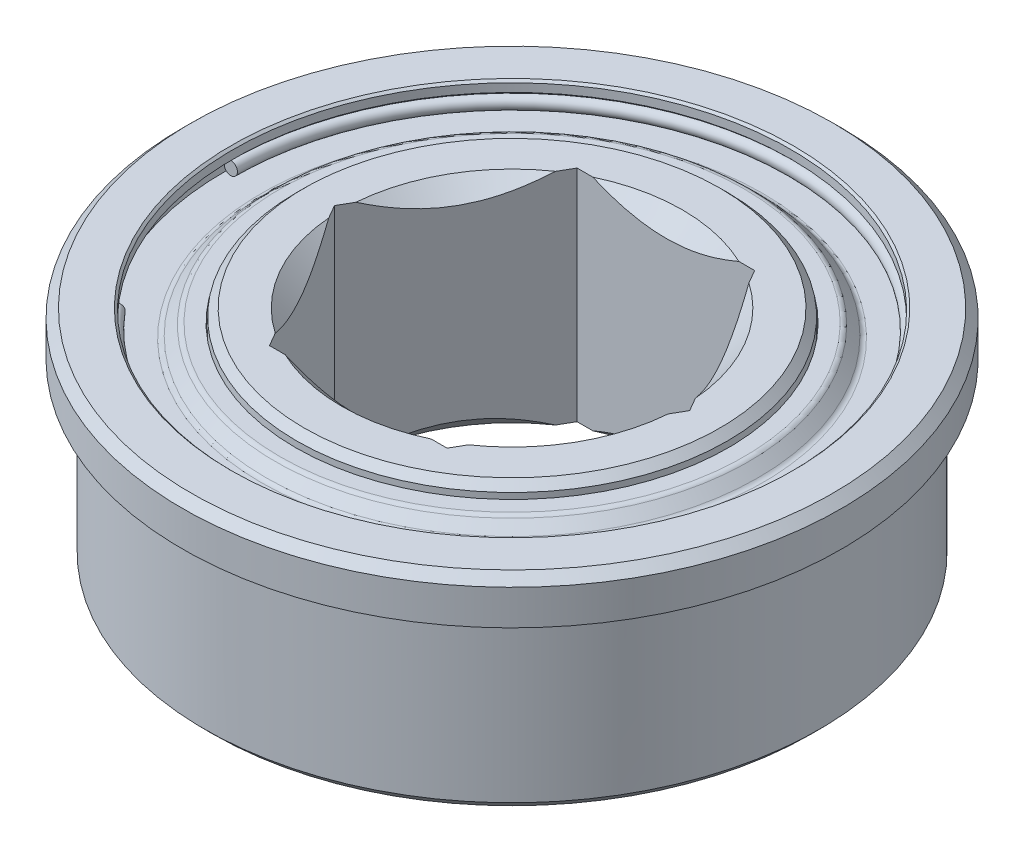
ISO-10303-21;
HEADER;
FILE_DESCRIPTION(('STEP AP214'),'2;1');
FILE_NAME('part.step','',(''),(''),'','','');
FILE_SCHEMA(('AUTOMOTIVE_DESIGN { 1 0 10303 214 1 1 1 1 }'));
ENDSEC;
DATA;
#1=APPLICATION_CONTEXT('core data for automotive mechanical design processes');
#2=APPLICATION_PROTOCOL_DEFINITION('international standard','automotive_design',2000,#1);
#3=PRODUCT_CONTEXT('',#1,'mechanical');
#4=PRODUCT('Part','Part','',(#3));
#5=PRODUCT_RELATED_PRODUCT_CATEGORY('part','',(#4));
#6=PRODUCT_DEFINITION_FORMATION('','',#4);
#7=PRODUCT_DEFINITION_CONTEXT('part definition',#1,'design');
#8=PRODUCT_DEFINITION('design','',#6,#7);
#9=PRODUCT_DEFINITION_SHAPE('','',#8);
#10=(LENGTH_UNIT() NAMED_UNIT(*) SI_UNIT(.MILLI.,.METRE.));
#11=(NAMED_UNIT(*) PLANE_ANGLE_UNIT() SI_UNIT($,.RADIAN.));
#12=(NAMED_UNIT(*) SI_UNIT($,.STERADIAN.) SOLID_ANGLE_UNIT());
#13=UNCERTAINTY_MEASURE_WITH_UNIT(LENGTH_MEASURE(1.E-05),#10,'distance_accuracy_value','');
#14=(GEOMETRIC_REPRESENTATION_CONTEXT(3) GLOBAL_UNCERTAINTY_ASSIGNED_CONTEXT((#13)) GLOBAL_UNIT_ASSIGNED_CONTEXT((#10,
#11,#12)) REPRESENTATION_CONTEXT('',''));
#15=CARTESIAN_POINT('',(0.,0.,0.));
#16=DIRECTION('',(0.,0.,1.));
#17=DIRECTION('',(1.,0.,0.));
#18=AXIS2_PLACEMENT_3D('',#15,#16,#17);
#19=CARTESIAN_POINT('',(0.,4.99999999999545,0.));
#20=DIRECTION('',(0.,1.,0.));
#21=DIRECTION('',(0.,0.,1.));
#22=AXIS2_PLACEMENT_3D('',#19,#20,#21);
#23=CONICAL_SURFACE('',#22,3.87499999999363,0.785398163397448);
#24=CARTESIAN_POINT('',(1.6630168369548,5.0000000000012,3.5));
#25=CARTESIAN_POINT('',(1.55372413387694,4.95309837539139,3.5));
#26=CARTESIAN_POINT('',(1.44296762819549,4.90933243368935,3.5));
#27=CARTESIAN_POINT('',(1.21833331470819,4.82949408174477,3.5));
#28=CARTESIAN_POINT('',(1.10444665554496,4.79344673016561,3.5));
#29=CARTESIAN_POINT('',(0.874450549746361,4.73089405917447,3.5));
#30=CARTESIAN_POINT('',(0.758349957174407,4.70435677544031,3.5));
#31=CARTESIAN_POINT('',(0.524320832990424,4.66219043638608,3.5));
#32=CARTESIAN_POINT('',(0.406395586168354,4.64654368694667,3.5));
#33=CARTESIAN_POINT('',(0.24011824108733,4.63290038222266,3.5));
#34=CARTESIAN_POINT('',(0.192140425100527,4.6299416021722,3.5));
#35=CARTESIAN_POINT('',(0.0961105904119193,4.62599078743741,3.5));
#36=CARTESIAN_POINT('',(0.0480585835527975,4.62499846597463,3.5));
#37=CARTESIAN_POINT('',(-0.1063146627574,4.62500339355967,3.5));
#38=CARTESIAN_POINT('',(-0.212661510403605,4.62987049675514,3.5));
#39=CARTESIAN_POINT('',(-0.424540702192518,4.64907157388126,3.5));
#40=CARTESIAN_POINT('',(-0.530072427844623,4.66341213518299,3.5));
#41=CARTESIAN_POINT('',(-0.739862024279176,4.70085053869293,3.5));
#42=CARTESIAN_POINT('',(-0.844115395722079,4.72397327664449,3.5));
#43=CARTESIAN_POINT('',(-1.05061222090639,4.77792252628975,3.5));
#44=CARTESIAN_POINT('',(-1.15285520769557,4.80875080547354,3.5));
#45=CARTESIAN_POINT('',(-1.32336901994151,4.86626089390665,3.5));
#46=CARTESIAN_POINT('',(-1.39223531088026,4.89120965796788,3.5));
#47=CARTESIAN_POINT('',(-1.52857599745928,4.94371872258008,3.5));
#48=CARTESIAN_POINT('',(-1.59605559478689,4.97126548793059,3.5));
#49=CARTESIAN_POINT('',(-1.66301683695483,5.0000000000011,3.5));
#50=B_SPLINE_CURVE_WITH_KNOTS('',3,(#24,#25,#26,#27,#28,#29,#30,#31,#32,#33,#34,#35,#36,#37,#38,
#39,#40,#41,#42,#43,#44,#45,#46,#47,#48,#49),.UNSPECIFIED.,.F.,.F.,(4,2,2,2,2,2,2,2,2,2,2,2,4),
(0.,0.356909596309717,0.714960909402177,1.07179723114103,1.42805243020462,1.57222598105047,
1.71637850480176,2.03527111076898,2.3543856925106,2.67441173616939,2.99451125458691,
3.21419443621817,3.43279043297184),.UNSPECIFIED.);
#51=CARTESIAN_POINT('',(1.66301683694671,4.99999999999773,3.5));
#52=VERTEX_POINT('',#51);
#53=CARTESIAN_POINT('',(-1.66301683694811,4.99999999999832,3.5));
#54=VERTEX_POINT('',#53);
#55=EDGE_CURVE('P0_E200',#52,#54,#50,.T.);
#56=ORIENTED_EDGE('',*,*,#55,.T.);
#57=CARTESIAN_POINT('',(0.,4.99999999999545,0.));
#58=DIRECTION('',(0.,1.,0.));
#59=DIRECTION('',(0.,0.,1.));
#60=AXIS2_PLACEMENT_3D('',#57,#58,#59);
#61=CIRCLE('',#60,3.87499999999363);
#62=EDGE_CURVE('P0_E696',#52,#54,#61,.F.);
#63=ORIENTED_EDGE('',*,*,#62,.F.);
#64=EDGE_LOOP('',(#56,#63));
#65=FACE_BOUND('',#64,.T.);
#66=ADVANCED_FACE('P0_F17',(#65),#23,.F.);
#67=CARTESIAN_POINT('',(0.,-1.13686837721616E-10,0.));
#68=DIRECTION('',(0.,-1.,0.));
#69=DIRECTION('',(0.,0.,-1.));
#70=AXIS2_PLACEMENT_3D('',#67,#68,#69);
#71=CONICAL_SURFACE('',#70,3.87500000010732,0.785398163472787);
#72=CARTESIAN_POINT('',(-1.66301683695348,-5.17818859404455E-12,3.5));
#73=CARTESIAN_POINT('',(-1.55372413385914,0.0469016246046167,3.5));
#74=CARTESIAN_POINT('',(-1.44296762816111,0.0906675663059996,3.5));
#75=CARTESIAN_POINT('',(-1.21833331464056,0.170505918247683,3.5));
#76=CARTESIAN_POINT('',(-1.10444665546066,0.206553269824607,3.5));
#77=CARTESIAN_POINT('',(-0.87445054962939,0.269105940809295,3.5));
#78=CARTESIAN_POINT('',(-0.758349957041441,0.295643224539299,3.5));
#79=CARTESIAN_POINT('',(-0.524320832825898,0.337809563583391,3.5));
#80=CARTESIAN_POINT('',(-0.406395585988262,0.353456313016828,3.5));
#81=CARTESIAN_POINT('',(-0.240118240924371,0.367099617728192,3.5));
#82=CARTESIAN_POINT('',(-0.192140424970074,0.3700583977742,3.5));
#83=CARTESIAN_POINT('',(-0.096110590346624,0.374009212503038,3.5));
#84=CARTESIAN_POINT('',(-0.0480585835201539,0.375001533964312,3.5));
#85=CARTESIAN_POINT('',(0.106314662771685,0.37499660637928,3.5));
#86=CARTESIAN_POINT('',(0.212661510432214,0.370129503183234,3.5));
#87=CARTESIAN_POINT('',(0.424540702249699,0.350928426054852,3.5));
#88=CARTESIAN_POINT('',(0.530072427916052,0.336587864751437,3.5));
#89=CARTESIAN_POINT('',(0.739862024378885,0.299149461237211,3.5));
#90=CARTESIAN_POINT('',(0.844115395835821,0.276026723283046,3.5));
#91=CARTESIAN_POINT('',(1.05061222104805,0.222077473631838,3.5));
#92=CARTESIAN_POINT('',(1.15285520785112,0.191249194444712,3.5));
#93=CARTESIAN_POINT('',(1.32336902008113,0.133739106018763,3.5));
#94=CARTESIAN_POINT('',(1.3922353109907,0.108790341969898,3.5));
#95=CARTESIAN_POINT('',(1.52857599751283,0.0562812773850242,3.5));
#96=CARTESIAN_POINT('',(1.59605559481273,0.0287345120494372,3.5));
#97=CARTESIAN_POINT('',(1.66301683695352,-5.07773983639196E-12,3.5));
#98=B_SPLINE_CURVE_WITH_KNOTS('',3,(#72,#73,#74,#75,#76,#77,#78,#79,#80,#81,#82,#83,#84,#85,#86,
#87,#88,#89,#90,#91,#92,#93,#94,#95,#96,#97),.UNSPECIFIED.,.F.,.F.,(4,2,2,2,2,2,2,2,2,2,2,2,4),
(0.,0.356909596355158,0.714960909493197,1.07179723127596,1.42805243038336,1.57222598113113,
1.71637850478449,2.03527111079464,2.35438569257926,2.67441173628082,2.9945112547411,
3.21419443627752,3.43279043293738),.UNSPECIFIED.);
#99=CARTESIAN_POINT('',(-1.66301683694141,0.,3.5));
#100=VERTEX_POINT('',#99);
#101=CARTESIAN_POINT('',(1.66301683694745,-2.58923310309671E-12,3.5));
#102=VERTEX_POINT('',#101);
#103=EDGE_CURVE('P0_E177',#100,#102,#98,.T.);
#104=ORIENTED_EDGE('',*,*,#103,.T.);
#105=CARTESIAN_POINT('',(0.,0.,0.));
#106=DIRECTION('',(0.,-1.,0.));
#107=DIRECTION('',(0.,0.,-1.));
#108=AXIS2_PLACEMENT_3D('',#105,#106,#107);
#109=CIRCLE('',#108,3.87499999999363);
#110=EDGE_CURVE('P0_E169',#100,#102,#109,.F.);
#111=ORIENTED_EDGE('',*,*,#110,.F.);
#112=EDGE_LOOP('',(#104,#111));
#113=FACE_BOUND('',#112,.T.);
#114=ADVANCED_FACE('P0_F181',(#113),#71,.F.);
#115=CARTESIAN_POINT('',(0.,5.,0.));
#116=DIRECTION('',(0.,1.,0.));
#117=DIRECTION('',(0.,0.,1.));
#118=AXIS2_PLACEMENT_3D('',#115,#116,#117);
#119=PLANE('',#118);
#120=CARTESIAN_POINT('',(0.,5.0000000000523,0.));
#121=DIRECTION('',(0.,-1.,0.));
#122=DIRECTION('',(0.,0.,-1.));
#123=AXIS2_PLACEMENT_3D('',#120,#121,#122);
#124=CIRCLE('',#123,4.72999999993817);
#125=CARTESIAN_POINT('',(0.,5.0000000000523,-4.72999999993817));
#126=VERTEX_POINT('',#125);
#127=EDGE_CURVE('P0_E659',#126,#126,#124,.T.);
#128=ORIENTED_EDGE('',*,*,#127,.F.);
#129=EDGE_LOOP('',(#128));
#130=FACE_BOUND('',#129,.T.);
#131=DIRECTION('',(0.499999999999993,0.,0.866025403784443));
#132=VECTOR('',#131,1.);
#133=CARTESIAN_POINT('',(3.86259733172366,5.,-0.309785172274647));
#134=LINE('',#133,#132);
#135=CARTESIAN_POINT('',(3.8625973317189,4.99999999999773,-0.309785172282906));
#136=VERTEX_POINT('',#135);
#137=CARTESIAN_POINT('',(4.04145188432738,5.,0.));
#138=VERTEX_POINT('',#137);
#139=EDGE_CURVE('P0_E660',#136,#138,#134,.T.);
#140=ORIENTED_EDGE('',*,*,#139,.T.);
#141=DIRECTION('',(-0.499999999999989,0.,0.866025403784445));
#142=VECTOR('',#141,1.);
#143=CARTESIAN_POINT('',(4.04145188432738,5.,0.));
#144=LINE('',#143,#142);
#145=CARTESIAN_POINT('',(3.8625973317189,4.99999999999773,0.309785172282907));
#146=VERTEX_POINT('',#145);
#147=EDGE_CURVE('P0_E657',#138,#146,#144,.T.);
#148=ORIENTED_EDGE('',*,*,#147,.T.);
#149=CARTESIAN_POINT('',(0.,4.99999999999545,0.));
#150=DIRECTION('',(0.,1.,0.));
#151=DIRECTION('',(0.,0.,1.));
#152=AXIS2_PLACEMENT_3D('',#149,#150,#151);
#153=CIRCLE('',#152,3.87499999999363);
#154=CARTESIAN_POINT('',(2.19958049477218,4.99999999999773,3.1902148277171));
#155=VERTEX_POINT('',#154);
#156=EDGE_CURVE('P0_E634',#146,#155,#153,.F.);
#157=ORIENTED_EDGE('',*,*,#156,.T.);
#158=DIRECTION('',(-0.500000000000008,0.,0.866025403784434));
#159=VECTOR('',#158,1.);
#160=CARTESIAN_POINT('',(2.19958049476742,5.,3.19021482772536));
#161=LINE('',#160,#159);
#162=CARTESIAN_POINT('',(2.02072594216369,5.,3.5));
#163=VERTEX_POINT('',#162);
#164=EDGE_CURVE('P0_E183',#155,#163,#161,.T.);
#165=ORIENTED_EDGE('',*,*,#164,.T.);
#166=DIRECTION('',(1.,0.,0.));
#167=VECTOR('',#166,1.);
#168=CARTESIAN_POINT('',(0.,5.,3.5));
#169=LINE('',#168,#167);
#170=EDGE_CURVE('P0_E628',#163,#52,#169,.F.);
#171=ORIENTED_EDGE('',*,*,#170,.T.);
#172=ORIENTED_EDGE('',*,*,#62,.T.);
#173=DIRECTION('',(1.,0.,0.));
#174=VECTOR('',#173,1.);
#175=CARTESIAN_POINT('',(0.,5.,3.5));
#176=LINE('',#175,#174);
#177=CARTESIAN_POINT('',(-2.02072594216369,5.,3.5));
#178=VERTEX_POINT('',#177);
#179=EDGE_CURVE('P0_E178',#54,#178,#176,.F.);
#180=ORIENTED_EDGE('',*,*,#179,.T.);
#181=DIRECTION('',(-0.499999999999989,0.,-0.866025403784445));
#182=VECTOR('',#181,1.);
#183=CARTESIAN_POINT('',(-2.02072594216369,5.,3.5));
#184=LINE('',#183,#182);
#185=CARTESIAN_POINT('',(-2.19958049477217,4.99999999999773,3.19021482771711));
#186=VERTEX_POINT('',#185);
#187=EDGE_CURVE('P0_E692',#178,#186,#184,.T.);
#188=ORIENTED_EDGE('',*,*,#187,.T.);
#189=CARTESIAN_POINT('',(0.,4.99999999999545,0.));
#190=DIRECTION('',(0.,1.,0.));
#191=DIRECTION('',(0.,0.,1.));
#192=AXIS2_PLACEMENT_3D('',#189,#190,#191);
#193=CIRCLE('',#192,3.87499999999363);
#194=CARTESIAN_POINT('',(-3.8625973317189,4.99999999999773,0.309785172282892));
#195=VERTEX_POINT('',#194);
#196=EDGE_CURVE('P0_E188',#186,#195,#193,.F.);
#197=ORIENTED_EDGE('',*,*,#196,.T.);
#198=DIRECTION('',(-0.500000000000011,0.,-0.866025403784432));
#199=VECTOR('',#198,1.);
#200=CARTESIAN_POINT('',(-3.86259733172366,5.,0.309785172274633));
#201=LINE('',#200,#199);
#202=CARTESIAN_POINT('',(-4.04145188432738,5.,0.));
#203=VERTEX_POINT('',#202);
#204=EDGE_CURVE('P0_E687',#195,#203,#201,.T.);
#205=ORIENTED_EDGE('',*,*,#204,.T.);
#206=DIRECTION('',(0.500000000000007,0.,-0.866025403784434));
#207=VECTOR('',#206,1.);
#208=CARTESIAN_POINT('',(-4.04145188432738,5.,0.));
#209=LINE('',#208,#207);
#210=CARTESIAN_POINT('',(-3.8625973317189,4.99999999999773,-0.30978517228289));
#211=VERTEX_POINT('',#210);
#212=EDGE_CURVE('P0_E683',#203,#211,#209,.T.);
#213=ORIENTED_EDGE('',*,*,#212,.T.);
#214=CARTESIAN_POINT('',(0.,4.99999999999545,0.));
#215=DIRECTION('',(0.,1.,0.));
#216=DIRECTION('',(0.,0.,1.));
#217=AXIS2_PLACEMENT_3D('',#214,#215,#216);
#218=CIRCLE('',#217,3.87499999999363);
#219=CARTESIAN_POINT('',(-2.19958049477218,4.99999999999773,-3.1902148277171));
#220=VERTEX_POINT('',#219);
#221=EDGE_CURVE('P0_E819',#211,#220,#218,.F.);
#222=ORIENTED_EDGE('',*,*,#221,.T.);
#223=DIRECTION('',(0.499999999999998,0.,-0.86602540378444));
#224=VECTOR('',#223,1.);
#225=CARTESIAN_POINT('',(-2.19958049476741,5.,-3.19021482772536));
#226=LINE('',#225,#224);
#227=CARTESIAN_POINT('',(-2.02072594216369,5.,-3.5));
#228=VERTEX_POINT('',#227);
#229=EDGE_CURVE('P0_E678',#220,#228,#226,.T.);
#230=ORIENTED_EDGE('',*,*,#229,.T.);
#231=DIRECTION('',(1.,0.,0.));
#232=VECTOR('',#231,1.);
#233=CARTESIAN_POINT('',(0.,5.,-3.5));
#234=LINE('',#233,#232);
#235=CARTESIAN_POINT('',(-1.66301683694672,4.99999999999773,-3.5));
#236=VERTEX_POINT('',#235);
#237=EDGE_CURVE('P0_E674',#228,#236,#234,.T.);
#238=ORIENTED_EDGE('',*,*,#237,.T.);
#239=CARTESIAN_POINT('',(0.,4.99999999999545,0.));
#240=DIRECTION('',(0.,1.,0.));
#241=DIRECTION('',(0.,0.,1.));
#242=AXIS2_PLACEMENT_3D('',#239,#240,#241);
#243=CIRCLE('',#242,3.87499999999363);
#244=CARTESIAN_POINT('',(1.66301683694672,4.99999999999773,-3.5));
#245=VERTEX_POINT('',#244);
#246=EDGE_CURVE('P0_E814',#236,#245,#243,.F.);
#247=ORIENTED_EDGE('',*,*,#246,.T.);
#248=DIRECTION('',(1.,0.,0.));
#249=VECTOR('',#248,1.);
#250=CARTESIAN_POINT('',(0.,5.,-3.5));
#251=LINE('',#250,#249);
#252=CARTESIAN_POINT('',(2.02072594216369,5.,-3.5));
#253=VERTEX_POINT('',#252);
#254=EDGE_CURVE('P0_E669',#245,#253,#251,.T.);
#255=ORIENTED_EDGE('',*,*,#254,.T.);
#256=DIRECTION('',(0.500000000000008,0.,0.866025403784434));
#257=VECTOR('',#256,1.);
#258=CARTESIAN_POINT('',(2.02072594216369,5.,-3.5));
#259=LINE('',#258,#257);
#260=CARTESIAN_POINT('',(2.19958049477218,4.99999999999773,-3.1902148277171));
#261=VERTEX_POINT('',#260);
#262=EDGE_CURVE('P0_E665',#253,#261,#259,.T.);
#263=ORIENTED_EDGE('',*,*,#262,.T.);
#264=CARTESIAN_POINT('',(0.,4.99999999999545,0.));
#265=DIRECTION('',(0.,1.,0.));
#266=DIRECTION('',(0.,0.,1.));
#267=AXIS2_PLACEMENT_3D('',#264,#265,#266);
#268=CIRCLE('',#267,3.87499999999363);
#269=EDGE_CURVE('P0_E813',#261,#136,#268,.F.);
#270=ORIENTED_EDGE('',*,*,#269,.T.);
#271=EDGE_LOOP('',(#140,#148,#157,#165,#171,#172,#180,#188,#197,#205,#213,#222,#230,#238,#247,
#255,#263,#270));
#272=FACE_BOUND('',#271,.T.);
#273=ADVANCED_FACE('P0_F349',(#130,#272),#119,.T.);
#274=CARTESIAN_POINT('',(0.,4.83000000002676,0.));
#275=DIRECTION('',(0.,-1.,0.));
#276=DIRECTION('',(0.,0.,-1.));
#277=AXIS2_PLACEMENT_3D('',#274,#275,#276);
#278=CONICAL_SURFACE('',#277,4.89999999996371,0.785398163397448);
#279=CARTESIAN_POINT('',(0.,4.83,0.));
#280=DIRECTION('',(0.,1.,0.));
#281=DIRECTION('',(0.,0.,1.));
#282=AXIS2_PLACEMENT_3D('',#279,#280,#281);
#283=CIRCLE('',#282,4.9);
#284=CARTESIAN_POINT('',(0.,4.83,4.9));
#285=VERTEX_POINT('',#284);
#286=EDGE_CURVE('P0_E191',#285,#285,#283,.F.);
#287=ORIENTED_EDGE('',*,*,#286,.F.);
#288=EDGE_LOOP('',(#287));
#289=FACE_BOUND('',#288,.T.);
#290=ORIENTED_EDGE('',*,*,#127,.T.);
#291=EDGE_LOOP('',(#290));
#292=FACE_BOUND('',#291,.T.);
#293=ADVANCED_FACE('P0_F346',(#289,#292),#278,.T.);
#294=CARTESIAN_POINT('',(0.,4.99999999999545,0.));
#295=DIRECTION('',(0.,1.,0.));
#296=DIRECTION('',(0.,0.,1.));
#297=AXIS2_PLACEMENT_3D('',#294,#295,#296);
#298=CONICAL_SURFACE('',#297,3.87499999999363,0.785398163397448);
#299=CARTESIAN_POINT('',(-3.86259733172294,5.0000000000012,-0.309785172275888));
#300=CARTESIAN_POINT('',(-3.80229397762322,4.94823979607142,-0.414233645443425));
#301=CARTESIAN_POINT('',(-3.74108512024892,4.90029234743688,-0.520250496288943));
#302=CARTESIAN_POINT('',(-3.6167825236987,4.81397240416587,-0.735548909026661));
#303=CARTESIAN_POINT('',(-3.55368310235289,4.77563289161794,-0.844840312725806));
#304=CARTESIAN_POINT('',(-3.42661824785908,4.71120349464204,-1.06492309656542));
#305=CARTESIAN_POINT('',(-3.36266926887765,4.68498711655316,-1.17568597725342));
#306=CARTESIAN_POINT('',(-3.23381873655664,4.64611091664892,-1.3988616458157));
#307=CARTESIAN_POINT('',(-3.16891865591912,4.6334320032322,-1.51127188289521));
#308=CARTESIAN_POINT('',(-3.04262244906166,4.62293511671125,-1.73002332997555));
#309=CARTESIAN_POINT('',(-2.98124358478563,4.62429071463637,-1.83633464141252));
#310=CARTESIAN_POINT('',(-2.85886732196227,4.63978476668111,-2.04829654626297));
#311=CARTESIAN_POINT('',(-2.7978701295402,4.6539296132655,-2.15394678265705));
#312=CARTESIAN_POINT('',(-2.67689893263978,4.69397122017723,-2.36347504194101));
#313=CARTESIAN_POINT('',(-2.61692446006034,4.71986244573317,-2.46735387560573));
#314=CARTESIAN_POINT('',(-2.49830382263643,4.78181692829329,-2.67281084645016));
#315=CARTESIAN_POINT('',(-2.43965803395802,4.8178830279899,-2.77438833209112));
#316=CARTESIAN_POINT('',(-2.35093642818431,4.87960838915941,-2.92805866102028));
#317=CARTESIAN_POINT('',(-2.32032191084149,4.90225005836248,-2.98108456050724));
#318=CARTESIAN_POINT('',(-2.2595978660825,4.94961521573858,-3.08626169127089));
#319=CARTESIAN_POINT('',(-2.22948714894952,4.9743325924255,-3.13841498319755));
#320=CARTESIAN_POINT('',(-2.19958049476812,5.00000000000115,-3.19021482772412));
#321=B_SPLINE_CURVE_WITH_KNOTS('',3,(#299,#300,#301,#302,#303,#304,#305,#306,#307,#308,#309,
#310,#311,#312,#313,#314,#315,#316,#317,#318,#319,#320),.UNSPECIFIED.,.F.,.F.,(4,2,2,2,2,2,2,2,
2,2,4),(0.,0.393910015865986,0.789154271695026,1.1801759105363,1.57064536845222,
1.93825910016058,2.30605667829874,2.67368113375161,3.04140839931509,3.23721815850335,
3.43247035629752),.UNSPECIFIED.);
#322=EDGE_CURVE('P0_E332',#211,#220,#321,.T.);
#323=ORIENTED_EDGE('',*,*,#322,.T.);
#324=ORIENTED_EDGE('',*,*,#221,.F.);
#325=EDGE_LOOP('',(#323,#324));
#326=FACE_BOUND('',#325,.T.);
#327=ADVANCED_FACE('P0_F341',(#326),#298,.F.);
#328=CARTESIAN_POINT('',(0.,4.99999999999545,0.));
#329=DIRECTION('',(0.,1.,0.));
#330=DIRECTION('',(0.,0.,1.));
#331=AXIS2_PLACEMENT_3D('',#328,#329,#330);
#332=CONICAL_SURFACE('',#331,3.87499999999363,0.785398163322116);
#333=CARTESIAN_POINT('',(-1.6630168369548,5.0000000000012,-3.5));
#334=CARTESIAN_POINT('',(-1.54241012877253,4.94823979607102,-3.5));
#335=CARTESIAN_POINT('',(-1.4199924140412,4.90029234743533,-3.5));
#336=CARTESIAN_POINT('',(-1.17138722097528,4.81397240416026,-3.5));
#337=CARTESIAN_POINT('',(-1.04518837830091,4.77563289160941,-3.5));
#338=CARTESIAN_POINT('',(-0.791058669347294,4.71120349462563,-3.5));
#339=CARTESIAN_POINT('',(-0.663160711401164,4.68498711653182,-3.5));
#340=CARTESIAN_POINT('',(-0.405459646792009,4.64611091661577,-3.5));
#341=CARTESIAN_POINT('',(-0.275659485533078,4.63343200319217,-3.5));
#342=CARTESIAN_POINT('',(-0.0230670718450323,4.62293511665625,-3.5));
#343=CARTESIAN_POINT('',(0.0996906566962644,4.62429071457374,-3.5));
#344=CARTESIAN_POINT('',(0.344443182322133,4.63978476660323,-3.5));
#345=CARTESIAN_POINT('',(0.466437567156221,4.65392961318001,-3.5));
#346=CARTESIAN_POINT('',(0.708379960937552,4.69397122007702,-3.5));
#347=CARTESIAN_POINT('',(0.828328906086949,4.71986244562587,-3.5));
#348=CARTESIAN_POINT('',(1.06557018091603,4.78181692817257,-3.5));
#349=CARTESIAN_POINT('',(1.18286175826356,4.81788302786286,-3.5));
#350=CARTESIAN_POINT('',(1.36030496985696,4.87960838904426,-3.5));
#351=CARTESIAN_POINT('',(1.42153400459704,4.90225005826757,-3.5));
#352=CARTESIAN_POINT('',(1.54298209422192,4.94961521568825,-3.5));
#353=CARTESIAN_POINT('',(1.60320352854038,4.97433259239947,-3.5));
#354=CARTESIAN_POINT('',(1.66301683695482,5.00000000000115,-3.5));
#355=B_SPLINE_CURVE_WITH_KNOTS('',3,(#333,#334,#335,#336,#337,#338,#339,#340,#341,#342,#343,
#344,#345,#346,#347,#348,#349,#350,#351,#352,#353,#354),.UNSPECIFIED.,.F.,.F.,(4,2,2,2,2,2,2,2,
2,2,4),(0.,0.393910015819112,0.789154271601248,1.18017591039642,1.57064536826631,
1.93825909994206,2.30605667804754,2.67368113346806,3.04140839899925,3.23721815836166,
3.43247035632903),.UNSPECIFIED.);
#356=EDGE_CURVE('P0_E324',#236,#245,#355,.T.);
#357=ORIENTED_EDGE('',*,*,#356,.T.);
#358=ORIENTED_EDGE('',*,*,#246,.F.);
#359=EDGE_LOOP('',(#357,#358));
#360=FACE_BOUND('',#359,.T.);
#361=ADVANCED_FACE('P0_F338',(#360),#332,.F.);
#362=CARTESIAN_POINT('',(0.,4.99999999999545,0.));
#363=DIRECTION('',(0.,1.,0.));
#364=DIRECTION('',(0.,0.,1.));
#365=AXIS2_PLACEMENT_3D('',#362,#363,#364);
#366=CONICAL_SURFACE('',#365,3.87499999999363,0.785398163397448);
#367=CARTESIAN_POINT('',(2.19958049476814,5.0000000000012,-3.1902148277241));
#368=CARTESIAN_POINT('',(2.25988384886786,4.94823979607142,-3.08576635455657));
#369=CARTESIAN_POINT('',(2.32109270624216,4.90029234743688,-2.97974950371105));
#370=CARTESIAN_POINT('',(2.44539530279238,4.81397240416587,-2.76445109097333));
#371=CARTESIAN_POINT('',(2.50849472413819,4.77563289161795,-2.65515968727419));
#372=CARTESIAN_POINT('',(2.635559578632,4.71120349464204,-2.43507690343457));
#373=CARTESIAN_POINT('',(2.69950855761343,4.68498711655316,-2.32431402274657));
#374=CARTESIAN_POINT('',(2.82835908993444,4.64611091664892,-2.1011383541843));
#375=CARTESIAN_POINT('',(2.89325917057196,4.6334320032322,-1.98872811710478));
#376=CARTESIAN_POINT('',(3.01955537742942,4.62293511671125,-1.76997667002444));
#377=CARTESIAN_POINT('',(3.08093424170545,4.62429071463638,-1.66366535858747));
#378=CARTESIAN_POINT('',(3.2033105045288,4.63978476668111,-1.45170345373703));
#379=CARTESIAN_POINT('',(3.26430769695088,4.65392961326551,-1.34605321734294));
#380=CARTESIAN_POINT('',(3.3852788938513,4.69397122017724,-1.13652495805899));
#381=CARTESIAN_POINT('',(3.44525336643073,4.71986244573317,-1.03264612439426));
#382=CARTESIAN_POINT('',(3.56387400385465,4.7818169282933,-0.827189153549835));
#383=CARTESIAN_POINT('',(3.62251979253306,4.81788302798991,-0.725611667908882));
#384=CARTESIAN_POINT('',(3.71124139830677,4.87960838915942,-0.571941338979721));
#385=CARTESIAN_POINT('',(3.74185591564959,4.90225005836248,-0.518915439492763));
#386=CARTESIAN_POINT('',(3.80257996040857,4.94961521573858,-0.41373830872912));
#387=CARTESIAN_POINT('',(3.83269067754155,4.9743325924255,-0.361585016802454));
#388=CARTESIAN_POINT('',(3.86259733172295,5.00000000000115,-0.309785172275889));
#389=B_SPLINE_CURVE_WITH_KNOTS('',3,(#367,#368,#369,#370,#371,#372,#373,#374,#375,#376,#377,
#378,#379,#380,#381,#382,#383,#384,#385,#386,#387,#388),.UNSPECIFIED.,.F.,.F.,(4,2,2,2,2,2,2,2,
2,2,4),(0.,0.393910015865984,0.789154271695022,1.18017591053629,1.57064536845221,
1.93825910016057,2.30605667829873,2.67368113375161,3.04140839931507,3.23721815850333,
3.43247035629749),.UNSPECIFIED.);
#390=EDGE_CURVE('P0_E243',#261,#136,#389,.T.);
#391=ORIENTED_EDGE('',*,*,#390,.T.);
#392=ORIENTED_EDGE('',*,*,#269,.F.);
#393=EDGE_LOOP('',(#391,#392));
#394=FACE_BOUND('',#393,.T.);
#395=ADVANCED_FACE('P0_F220',(#394),#366,.F.);
#396=CARTESIAN_POINT('',(0.,4.99999999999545,0.));
#397=DIRECTION('',(0.,1.,0.));
#398=DIRECTION('',(0.,0.,1.));
#399=AXIS2_PLACEMENT_3D('',#396,#397,#398);
#400=CONICAL_SURFACE('',#399,3.87499999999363,0.785398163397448);
#401=CARTESIAN_POINT('',(3.86259733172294,5.0000000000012,0.309785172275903));
#402=CARTESIAN_POINT('',(3.80229397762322,4.94823979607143,0.41423364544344));
#403=CARTESIAN_POINT('',(3.74108512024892,4.90029234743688,0.520250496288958));
#404=CARTESIAN_POINT('',(3.6167825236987,4.81397240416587,0.735548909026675));
#405=CARTESIAN_POINT('',(3.55368310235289,4.77563289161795,0.844840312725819));
#406=CARTESIAN_POINT('',(3.42661824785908,4.71120349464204,1.06492309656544));
#407=CARTESIAN_POINT('',(3.36266926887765,4.68498711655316,1.17568597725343));
#408=CARTESIAN_POINT('',(3.23381873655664,4.64611091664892,1.39886164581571));
#409=CARTESIAN_POINT('',(3.16891865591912,4.63343200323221,1.51127188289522));
#410=CARTESIAN_POINT('',(3.04262244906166,4.62293511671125,1.73002332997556));
#411=CARTESIAN_POINT('',(2.98124358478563,4.62429071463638,1.83633464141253));
#412=CARTESIAN_POINT('',(2.85886732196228,4.63978476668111,2.04829654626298));
#413=CARTESIAN_POINT('',(2.7978701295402,4.65392961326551,2.15394678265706));
#414=CARTESIAN_POINT('',(2.67689893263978,4.69397122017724,2.36347504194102));
#415=CARTESIAN_POINT('',(2.61692446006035,4.71986244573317,2.46735387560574));
#416=CARTESIAN_POINT('',(2.49830382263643,4.7818169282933,2.67281084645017));
#417=CARTESIAN_POINT('',(2.43965803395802,4.81788302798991,2.77438833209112));
#418=CARTESIAN_POINT('',(2.35093642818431,4.87960838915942,2.92805866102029));
#419=CARTESIAN_POINT('',(2.32032191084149,4.90225005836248,2.98108456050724));
#420=CARTESIAN_POINT('',(2.25959786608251,4.94961521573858,3.08626169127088));
#421=CARTESIAN_POINT('',(2.22948714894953,4.9743325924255,3.13841498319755));
#422=CARTESIAN_POINT('',(2.19958049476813,5.00000000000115,3.19021482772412));
#423=B_SPLINE_CURVE_WITH_KNOTS('',3,(#401,#402,#403,#404,#405,#406,#407,#408,#409,#410,#411,
#412,#413,#414,#415,#416,#417,#418,#419,#420,#421,#422),.UNSPECIFIED.,.F.,.F.,(4,2,2,2,2,2,2,2,
2,2,4),(0.,0.393910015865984,0.789154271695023,1.18017591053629,1.57064536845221,
1.93825910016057,2.30605667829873,2.67368113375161,3.04140839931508,3.23721815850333,
3.43247035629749),.UNSPECIFIED.);
#424=EDGE_CURVE('P0_E225',#146,#155,#423,.T.);
#425=ORIENTED_EDGE('',*,*,#424,.T.);
#426=ORIENTED_EDGE('',*,*,#156,.F.);
#427=EDGE_LOOP('',(#425,#426));
#428=FACE_BOUND('',#427,.T.);
#429=ADVANCED_FACE('P0_F213',(#428),#400,.F.);
#430=CARTESIAN_POINT('',(0.,-3.90512483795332,3.5));
#431=DIRECTION('',(0.,0.,1.));
#432=DIRECTION('',(1.,0.,0.));
#433=AXIS2_PLACEMENT_3D('',#430,#431,#432);
#434=PLANE('',#433);
#435=DIRECTION('',(1.,0.,0.));
#436=VECTOR('',#435,1.);
#437=CARTESIAN_POINT('',(0.,0.,3.5));
#438=LINE('',#437,#436);
#439=CARTESIAN_POINT('',(-2.02072594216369,0.,3.5));
#440=VERTEX_POINT('',#439);
#441=EDGE_CURVE('P0_E166',#440,#100,#438,.T.);
#442=ORIENTED_EDGE('',*,*,#441,.F.);
#443=DIRECTION('',(0.,1.,0.));
#444=VECTOR('',#443,1.);
#445=CARTESIAN_POINT('',(-2.02072594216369,-3.90512483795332,3.5));
#446=LINE('',#445,#444);
#447=EDGE_CURVE('P0_E583',#440,#178,#446,.T.);
#448=ORIENTED_EDGE('',*,*,#447,.T.);
#449=ORIENTED_EDGE('',*,*,#179,.F.);
#450=ORIENTED_EDGE('',*,*,#55,.F.);
#451=ORIENTED_EDGE('',*,*,#170,.F.);
#452=DIRECTION('',(0.,1.,0.));
#453=VECTOR('',#452,1.);
#454=CARTESIAN_POINT('',(2.0207259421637,-3.90512483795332,3.5));
#455=LINE('',#454,#453);
#456=CARTESIAN_POINT('',(2.02072594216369,0.,3.5));
#457=VERTEX_POINT('',#456);
#458=EDGE_CURVE('P0_E234',#163,#457,#455,.F.);
#459=ORIENTED_EDGE('',*,*,#458,.T.);
#460=DIRECTION('',(1.,0.,0.));
#461=VECTOR('',#460,1.);
#462=CARTESIAN_POINT('',(0.,0.,3.5));
#463=LINE('',#462,#461);
#464=EDGE_CURVE('P0_E187',#102,#457,#463,.T.);
#465=ORIENTED_EDGE('',*,*,#464,.F.);
#466=ORIENTED_EDGE('',*,*,#103,.F.);
#467=EDGE_LOOP('',(#442,#448,#449,#450,#451,#459,#465,#466));
#468=FACE_BOUND('',#467,.T.);
#469=ADVANCED_FACE('P0_F185',(#468),#434,.F.);
#470=CARTESIAN_POINT('',(0.,4.99999999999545,0.));
#471=DIRECTION('',(0.,1.,0.));
#472=DIRECTION('',(0.,0.,1.));
#473=AXIS2_PLACEMENT_3D('',#470,#471,#472);
#474=CONICAL_SURFACE('',#473,3.87499999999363,0.785398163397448);
#475=CARTESIAN_POINT('',(-2.19958049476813,5.0000000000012,3.19021482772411));
#476=CARTESIAN_POINT('',(-2.25988384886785,4.94823979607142,3.08576635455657));
#477=CARTESIAN_POINT('',(-2.32109270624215,4.90029234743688,2.97974950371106));
#478=CARTESIAN_POINT('',(-2.44539530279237,4.81397240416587,2.76445109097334));
#479=CARTESIAN_POINT('',(-2.50849472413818,4.77563289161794,2.65515968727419));
#480=CARTESIAN_POINT('',(-2.63555957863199,4.71120349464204,2.43507690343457));
#481=CARTESIAN_POINT('',(-2.69950855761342,4.68498711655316,2.32431402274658));
#482=CARTESIAN_POINT('',(-2.82835908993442,4.64611091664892,2.1011383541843));
#483=CARTESIAN_POINT('',(-2.89325917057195,4.6334320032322,1.98872811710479));
#484=CARTESIAN_POINT('',(-3.01955537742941,4.62293511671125,1.76997667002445));
#485=CARTESIAN_POINT('',(-3.08093424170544,4.62429071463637,1.66366535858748));
#486=CARTESIAN_POINT('',(-3.20331050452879,4.6397847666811,1.45170345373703));
#487=CARTESIAN_POINT('',(-3.26430769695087,4.6539296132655,1.34605321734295));
#488=CARTESIAN_POINT('',(-3.38527889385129,4.69397122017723,1.13652495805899));
#489=CARTESIAN_POINT('',(-3.44525336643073,4.71986244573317,1.03264612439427));
#490=CARTESIAN_POINT('',(-3.56387400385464,4.78181692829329,0.827189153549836));
#491=CARTESIAN_POINT('',(-3.62251979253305,4.8178830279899,0.725611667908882));
#492=CARTESIAN_POINT('',(-3.71124139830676,4.87960838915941,0.571941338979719));
#493=CARTESIAN_POINT('',(-3.74185591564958,4.90225005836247,0.518915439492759));
#494=CARTESIAN_POINT('',(-3.80257996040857,4.94961521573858,0.413738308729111));
#495=CARTESIAN_POINT('',(-3.83269067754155,4.9743325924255,0.361585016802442));
#496=CARTESIAN_POINT('',(-3.86259733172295,5.00000000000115,0.309785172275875));
#497=B_SPLINE_CURVE_WITH_KNOTS('',3,(#475,#476,#477,#478,#479,#480,#481,#482,#483,#484,#485,
#486,#487,#488,#489,#490,#491,#492,#493,#494,#495,#496),.UNSPECIFIED.,.F.,.F.,(4,2,2,2,2,2,2,2,
2,2,4),(0.,0.393910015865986,0.789154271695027,1.1801759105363,1.57064536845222,
1.93825910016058,2.30605667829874,2.67368113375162,3.04140839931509,3.23721815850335,
3.43247035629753),.UNSPECIFIED.);
#498=EDGE_CURVE('P0_E236',#186,#195,#497,.T.);
#499=ORIENTED_EDGE('',*,*,#498,.T.);
#500=ORIENTED_EDGE('',*,*,#196,.F.);
#501=EDGE_LOOP('',(#499,#500));
#502=FACE_BOUND('',#501,.T.);
#503=ADVANCED_FACE('P0_F212',(#502),#474,.F.);
#504=CARTESIAN_POINT('',(0.,4.71,0.));
#505=DIRECTION('',(0.,1.,0.));
#506=DIRECTION('',(0.,0.,1.));
#507=AXIS2_PLACEMENT_3D('',#504,#505,#506);
#508=CYLINDRICAL_SURFACE('',#507,4.9);
#509=ORIENTED_EDGE('',*,*,#286,.T.);
#510=EDGE_LOOP('',(#509));
#511=FACE_BOUND('',#510,.T.);
#512=CARTESIAN_POINT('',(0.,4.456,0.));
#513=DIRECTION('',(0.,1.,0.));
#514=DIRECTION('',(0.,0.,1.));
#515=AXIS2_PLACEMENT_3D('',#512,#513,#514);
#516=CIRCLE('',#515,4.9);
#517=CARTESIAN_POINT('',(0.,4.456,4.9));
#518=VERTEX_POINT('',#517);
#519=EDGE_CURVE('P0_E578',#518,#518,#516,.F.);
#520=ORIENTED_EDGE('',*,*,#519,.F.);
#521=EDGE_LOOP('',(#520));
#522=FACE_BOUND('',#521,.T.);
#523=ADVANCED_FACE('P0_F1009',(#511,#522),#508,.T.);
#524=CARTESIAN_POINT('',(-3.03108891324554,-3.90512483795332,-1.75));
#525=DIRECTION('',(-0.866025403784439,0.,-0.499999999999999));
#526=DIRECTION('',(-0.499999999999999,0.,0.866025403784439));
#527=AXIS2_PLACEMENT_3D('',#524,#525,#526);
#528=PLANE('',#527);
#529=DIRECTION('',(-0.499999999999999,0.,0.866025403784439));
#530=VECTOR('',#529,1.);
#531=CARTESIAN_POINT('',(-3.03108891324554,0.,-1.75));
#532=LINE('',#531,#530);
#533=CARTESIAN_POINT('',(-2.02072594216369,0.,-3.5));
#534=VERTEX_POINT('',#533);
#535=CARTESIAN_POINT('',(-2.19958049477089,-3.37356185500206E-12,-3.19021482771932));
#536=VERTEX_POINT('',#535);
#537=EDGE_CURVE('P0_E608',#534,#536,#532,.T.);
#538=ORIENTED_EDGE('',*,*,#537,.F.);
#539=DIRECTION('',(0.,1.,0.));
#540=VECTOR('',#539,1.);
#541=CARTESIAN_POINT('',(-2.02072594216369,-3.90512483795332,-3.5));
#542=LINE('',#541,#540);
#543=EDGE_CURVE('P0_E331',#534,#228,#542,.T.);
#544=ORIENTED_EDGE('',*,*,#543,.T.);
#545=ORIENTED_EDGE('',*,*,#229,.F.);
#546=ORIENTED_EDGE('',*,*,#322,.F.);
#547=ORIENTED_EDGE('',*,*,#212,.F.);
#548=DIRECTION('',(0.,1.,0.));
#549=VECTOR('',#548,1.);
#550=CARTESIAN_POINT('',(-4.04145188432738,-3.90512483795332,0.));
#551=LINE('',#550,#549);
#552=CARTESIAN_POINT('',(-4.04145188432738,0.,0.));
#553=VERTEX_POINT('',#552);
#554=EDGE_CURVE('P0_E579',#203,#553,#551,.F.);
#555=ORIENTED_EDGE('',*,*,#554,.T.);
#556=DIRECTION('',(-0.499999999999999,0.,0.866025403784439));
#557=VECTOR('',#556,1.);
#558=CARTESIAN_POINT('',(-3.03108891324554,0.,-1.75));
#559=LINE('',#558,#557);
#560=CARTESIAN_POINT('',(-3.86259733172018,-3.37357663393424E-12,-0.309785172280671));
#561=VERTEX_POINT('',#560);
#562=EDGE_CURVE('P0_E614',#561,#553,#559,.T.);
#563=ORIENTED_EDGE('',*,*,#562,.F.);
#564=CARTESIAN_POINT('',(-3.86259733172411,-6.74825344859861E-12,-0.309785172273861));
#565=CARTESIAN_POINT('',(-3.80229397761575,0.0517602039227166,-0.414233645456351));
#566=CARTESIAN_POINT('',(-3.74108512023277,0.0997076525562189,-0.520250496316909));
#567=CARTESIAN_POINT('',(-3.61678252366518,0.186027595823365,-0.73554890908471));
#568=CARTESIAN_POINT('',(-3.55368310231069,0.224367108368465,-0.844840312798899));
#569=CARTESIAN_POINT('',(-3.42661824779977,0.288796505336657,-1.06492309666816));
#570=CARTESIAN_POINT('',(-3.36266926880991,0.315012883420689,-1.17568597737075));
#571=CARTESIAN_POINT('',(-3.23381873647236,0.353889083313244,-1.39886164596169));
#572=CARTESIAN_POINT('',(-3.16891865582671,0.366567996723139,-1.51127188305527));
#573=CARTESIAN_POINT('',(-3.04262244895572,0.377064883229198,-1.73002333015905));
#574=CARTESIAN_POINT('',(-2.98124358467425,0.375709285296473,-1.83633464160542));
#575=CARTESIAN_POINT('',(-2.8588673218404,0.360215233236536,-2.04829654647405));
#576=CARTESIAN_POINT('',(-2.79787012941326,0.346070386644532,-2.15394678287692));
#577=CARTESIAN_POINT('',(-2.67689893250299,0.30602877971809,-2.36347504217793));
#578=CARTESIAN_POINT('',(-2.61692445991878,0.280137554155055,-2.46735387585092));
#579=CARTESIAN_POINT('',(-2.49830382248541,0.218183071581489,-2.67281084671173));
#580=CARTESIAN_POINT('',(-2.43965803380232,0.182116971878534,-2.7743883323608));
#581=CARTESIAN_POINT('',(-2.35093642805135,0.120391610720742,-2.92805866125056));
#582=CARTESIAN_POINT('',(-2.32032191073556,0.0977499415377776,-2.98108456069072));
#583=CARTESIAN_POINT('',(-2.25959786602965,0.0503847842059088,-3.08626169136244));
#584=CARTESIAN_POINT('',(-2.22948714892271,0.0256674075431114,-3.13841498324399));
#585=CARTESIAN_POINT('',(-2.19958049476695,-6.70364341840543E-12,-3.19021482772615));
#586=B_SPLINE_CURVE_WITH_KNOTS('',3,(#564,#565,#566,#567,#568,#569,#570,#571,#572,#573,#574,
#575,#576,#577,#578,#579,#580,#581,#582,#583,#584,#585),.UNSPECIFIED.,.F.,.F.,(4,2,2,2,2,2,2,2,
2,2,4),(0.,0.393910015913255,0.789154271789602,1.18017591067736,1.57064536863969,
1.93825910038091,2.30605667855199,2.67368113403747,3.04140839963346,3.23721815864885,
3.43247035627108),.UNSPECIFIED.);
#587=EDGE_CURVE('P0_E311',#561,#536,#586,.T.);
#588=ORIENTED_EDGE('',*,*,#587,.T.);
#589=EDGE_LOOP('',(#538,#544,#545,#546,#547,#555,#563,#588));
#590=FACE_BOUND('',#589,.T.);
#591=ADVANCED_FACE('P0_F320',(#590),#528,.F.);
#592=CARTESIAN_POINT('',(0.,-3.90512483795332,-3.5));
#593=DIRECTION('',(0.,0.,-1.));
#594=DIRECTION('',(-1.,0.,0.));
#595=AXIS2_PLACEMENT_3D('',#592,#593,#594);
#596=PLANE('',#595);
#597=DIRECTION('',(-1.,0.,0.));
#598=VECTOR('',#597,1.);
#599=CARTESIAN_POINT('',(0.,0.,-3.5));
#600=LINE('',#599,#598);
#601=CARTESIAN_POINT('',(2.02072594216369,0.,-3.5));
#602=VERTEX_POINT('',#601);
#603=CARTESIAN_POINT('',(1.66301683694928,-3.37395839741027E-12,-3.5));
#604=VERTEX_POINT('',#603);
#605=EDGE_CURVE('P0_E330',#602,#604,#600,.T.);
#606=ORIENTED_EDGE('',*,*,#605,.F.);
#607=DIRECTION('',(0.,1.,0.));
#608=VECTOR('',#607,1.);
#609=CARTESIAN_POINT('',(2.02072594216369,-3.90512483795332,-3.5));
#610=LINE('',#609,#608);
#611=EDGE_CURVE('P0_E600',#602,#253,#610,.T.);
#612=ORIENTED_EDGE('',*,*,#611,.T.);
#613=ORIENTED_EDGE('',*,*,#254,.F.);
#614=ORIENTED_EDGE('',*,*,#356,.F.);
#615=ORIENTED_EDGE('',*,*,#237,.F.);
#616=ORIENTED_EDGE('',*,*,#543,.F.);
#617=DIRECTION('',(-1.,0.,0.));
#618=VECTOR('',#617,1.);
#619=CARTESIAN_POINT('',(0.,0.,-3.5));
#620=LINE('',#619,#618);
#621=CARTESIAN_POINT('',(-1.66301683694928,-3.37431577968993E-12,-3.5));
#622=VERTEX_POINT('',#621);
#623=EDGE_CURVE('P0_E606',#622,#534,#620,.T.);
#624=ORIENTED_EDGE('',*,*,#623,.F.);
#625=CARTESIAN_POINT('',(-1.66301683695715,-6.74873897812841E-12,-3.5));
#626=CARTESIAN_POINT('',(-1.54241012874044,0.0517602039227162,-3.5));
#627=CARTESIAN_POINT('',(-1.41999241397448,0.0997076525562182,-3.5));
#628=CARTESIAN_POINT('',(-1.1713872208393,0.186027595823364,-3.5));
#629=CARTESIAN_POINT('',(-1.0451883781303,0.224367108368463,-3.5));
#630=CARTESIAN_POINT('',(-0.791058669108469,0.288796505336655,-3.5));
#631=CARTESIAN_POINT('',(-0.663160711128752,0.315012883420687,-3.5));
#632=CARTESIAN_POINT('',(-0.405459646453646,0.353889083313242,-3.5));
#633=CARTESIAN_POINT('',(-0.275659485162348,0.366567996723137,-3.5));
#634=CARTESIAN_POINT('',(-0.023067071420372,0.377064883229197,-3.5));
#635=CARTESIAN_POINT('',(0.0996906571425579,0.375709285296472,-3.5));
#636=CARTESIAN_POINT('',(0.344443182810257,0.360215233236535,-3.5));
#637=CARTESIAN_POINT('',(0.466437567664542,0.346070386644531,-3.5));
#638=CARTESIAN_POINT('',(0.708379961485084,0.306028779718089,-3.5));
#639=CARTESIAN_POINT('',(0.8283289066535,0.280137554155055,-3.5));
#640=CARTESIAN_POINT('',(1.06557018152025,0.218183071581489,-3.5));
#641=CARTESIAN_POINT('',(1.18286175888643,0.182116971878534,-3.5));
#642=CARTESIAN_POINT('',(1.36030497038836,0.120391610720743,-3.5));
#643=CARTESIAN_POINT('',(1.42153400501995,0.0977499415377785,-3.5));
#644=CARTESIAN_POINT('',(1.54298209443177,0.0503847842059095,-3.5));
#645=CARTESIAN_POINT('',(1.60320352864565,0.0256674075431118,-3.5));
#646=CARTESIAN_POINT('',(1.66301683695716,-6.70365553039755E-12,-3.5));
#647=B_SPLINE_CURVE_WITH_KNOTS('',3,(#625,#626,#627,#628,#629,#630,#631,#632,#633,#634,#635,
#636,#637,#638,#639,#640,#641,#642,#643,#644,#645,#646),.UNSPECIFIED.,.F.,.F.,(4,2,2,2,2,2,2,2,
2,2,4),(0.,0.393910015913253,0.789154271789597,1.18017591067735,1.57064536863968,
1.9382591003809,2.30605667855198,2.67368113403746,3.04140839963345,3.23721815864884,
3.43247035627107),.UNSPECIFIED.);
#648=EDGE_CURVE('P0_E304',#622,#604,#647,.T.);
#649=ORIENTED_EDGE('',*,*,#648,.T.);
#650=EDGE_LOOP('',(#606,#612,#613,#614,#615,#616,#624,#649));
#651=FACE_BOUND('',#650,.T.);
#652=ADVANCED_FACE('P0_F317',(#651),#596,.F.);
#653=CARTESIAN_POINT('',(3.03108891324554,-3.90512483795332,-1.75));
#654=DIRECTION('',(0.866025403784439,0.,-0.5));
#655=DIRECTION('',(-0.5,0.,-0.866025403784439));
#656=AXIS2_PLACEMENT_3D('',#653,#654,#655);
#657=PLANE('',#656);
#658=DIRECTION('',(-0.5,0.,-0.866025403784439));
#659=VECTOR('',#658,1.);
#660=CARTESIAN_POINT('',(3.03108891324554,0.,-1.75));
#661=LINE('',#660,#659);
#662=CARTESIAN_POINT('',(4.04145188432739,0.,0.));
#663=VERTEX_POINT('',#662);
#664=CARTESIAN_POINT('',(3.86259733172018,-3.37423430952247E-12,-0.309785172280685));
#665=VERTEX_POINT('',#664);
#666=EDGE_CURVE('P0_E592',#663,#665,#661,.T.);
#667=ORIENTED_EDGE('',*,*,#666,.F.);
#668=DIRECTION('',(0.,1.,0.));
#669=VECTOR('',#668,1.);
#670=CARTESIAN_POINT('',(4.04145188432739,-3.90512483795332,0.));
#671=LINE('',#670,#669);
#672=EDGE_CURVE('P0_E235',#663,#138,#671,.T.);
#673=ORIENTED_EDGE('',*,*,#672,.T.);
#674=ORIENTED_EDGE('',*,*,#139,.F.);
#675=ORIENTED_EDGE('',*,*,#390,.F.);
#676=ORIENTED_EDGE('',*,*,#262,.F.);
#677=ORIENTED_EDGE('',*,*,#611,.F.);
#678=DIRECTION('',(-0.5,0.,-0.866025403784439));
#679=VECTOR('',#678,1.);
#680=CARTESIAN_POINT('',(3.03108891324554,0.,-1.75));
#681=LINE('',#680,#679);
#682=CARTESIAN_POINT('',(2.1995804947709,-3.37421060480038E-12,-3.19021482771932));
#683=VERTEX_POINT('',#682);
#684=EDGE_CURVE('P0_E598',#683,#602,#681,.T.);
#685=ORIENTED_EDGE('',*,*,#684,.F.);
#686=CARTESIAN_POINT('',(2.19958049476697,-6.74838340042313E-12,-3.19021482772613));
#687=CARTESIAN_POINT('',(2.25988384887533,0.0517602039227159,-3.08576635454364));
#688=CARTESIAN_POINT('',(2.32109270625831,0.0997076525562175,-2.97974950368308));
#689=CARTESIAN_POINT('',(2.44539530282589,0.186027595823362,-2.76445109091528));
#690=CARTESIAN_POINT('',(2.50849472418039,0.224367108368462,-2.65515968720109));
#691=CARTESIAN_POINT('',(2.63555957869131,0.288796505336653,-2.43507690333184));
#692=CARTESIAN_POINT('',(2.69950855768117,0.315012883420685,-2.32431402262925));
#693=CARTESIAN_POINT('',(2.82835909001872,0.353889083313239,-2.10113835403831));
#694=CARTESIAN_POINT('',(2.89325917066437,0.366567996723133,-1.98872811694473));
#695=CARTESIAN_POINT('',(3.01955537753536,0.377064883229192,-1.76997666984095));
#696=CARTESIAN_POINT('',(3.08093424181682,0.375709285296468,-1.66366535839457));
#697=CARTESIAN_POINT('',(3.20331050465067,0.36021523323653,-1.45170345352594));
#698=CARTESIAN_POINT('',(3.26430769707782,0.346070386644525,-1.34605321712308));
#699=CARTESIAN_POINT('',(3.38527889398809,0.306028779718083,-1.13652495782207));
#700=CARTESIAN_POINT('',(3.44525336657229,0.280137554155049,-1.03264612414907));
#701=CARTESIAN_POINT('',(3.56387400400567,0.218183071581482,-0.827189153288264));
#702=CARTESIAN_POINT('',(3.62251979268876,0.182116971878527,-0.7256116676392));
#703=CARTESIAN_POINT('',(3.71124139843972,0.120391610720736,-0.571941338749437));
#704=CARTESIAN_POINT('',(3.74185591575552,0.0977499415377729,-0.518915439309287));
#705=CARTESIAN_POINT('',(3.80257996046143,0.0503847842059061,-0.413738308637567));
#706=CARTESIAN_POINT('',(3.83269067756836,0.0256674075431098,-0.361585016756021));
#707=CARTESIAN_POINT('',(3.86259733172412,-6.70403198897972E-12,-0.309785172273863));
#708=B_SPLINE_CURVE_WITH_KNOTS('',3,(#686,#687,#688,#689,#690,#691,#692,#693,#694,#695,#696,
#697,#698,#699,#700,#701,#702,#703,#704,#705,#706,#707),.UNSPECIFIED.,.F.,.F.,(4,2,2,2,2,2,2,2,
2,2,4),(0.,0.393910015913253,0.789154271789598,1.18017591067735,1.57064536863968,
1.9382591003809,2.30605667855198,2.67368113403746,3.04140839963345,3.23721815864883,
3.43247035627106),.UNSPECIFIED.);
#709=EDGE_CURVE('P0_E272',#683,#665,#708,.T.);
#710=ORIENTED_EDGE('',*,*,#709,.T.);
#711=EDGE_LOOP('',(#667,#673,#674,#675,#676,#677,#685,#710));
#712=FACE_BOUND('',#711,.T.);
#713=ADVANCED_FACE('P0_F254',(#712),#657,.F.);
#714=CARTESIAN_POINT('',(3.03108891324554,-3.90512483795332,1.75));
#715=DIRECTION('',(0.866025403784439,0.,0.5));
#716=DIRECTION('',(0.5,0.,-0.866025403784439));
#717=AXIS2_PLACEMENT_3D('',#714,#715,#716);
#718=PLANE('',#717);
#719=DIRECTION('',(0.5,0.,-0.866025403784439));
#720=VECTOR('',#719,1.);
#721=CARTESIAN_POINT('',(3.03108891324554,0.,1.75));
#722=LINE('',#721,#720);
#723=CARTESIAN_POINT('',(2.1995804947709,-3.37432966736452E-12,3.19021482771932));
#724=VERTEX_POINT('',#723);
#725=EDGE_CURVE('P0_E584',#457,#724,#722,.T.);
#726=ORIENTED_EDGE('',*,*,#725,.F.);
#727=ORIENTED_EDGE('',*,*,#458,.F.);
#728=ORIENTED_EDGE('',*,*,#164,.F.);
#729=ORIENTED_EDGE('',*,*,#424,.F.);
#730=ORIENTED_EDGE('',*,*,#147,.F.);
#731=ORIENTED_EDGE('',*,*,#672,.F.);
#732=DIRECTION('',(0.5,0.,-0.866025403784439));
#733=VECTOR('',#732,1.);
#734=CARTESIAN_POINT('',(3.03108891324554,0.,1.75));
#735=LINE('',#734,#733);
#736=CARTESIAN_POINT('',(3.86259733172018,-3.37487185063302E-12,0.309785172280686));
#737=VERTEX_POINT('',#736);
#738=EDGE_CURVE('P0_E590',#737,#663,#735,.T.);
#739=ORIENTED_EDGE('',*,*,#738,.F.);
#740=CARTESIAN_POINT('',(3.86259733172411,-6.74902469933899E-12,0.309785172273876));
#741=CARTESIAN_POINT('',(3.80229397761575,0.0517602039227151,0.414233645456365));
#742=CARTESIAN_POINT('',(3.74108512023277,0.0997076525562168,0.520250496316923));
#743=CARTESIAN_POINT('',(3.61678252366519,0.186027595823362,0.735548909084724));
#744=CARTESIAN_POINT('',(3.55368310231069,0.224367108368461,0.844840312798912));
#745=CARTESIAN_POINT('',(3.42661824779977,0.288796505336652,1.06492309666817));
#746=CARTESIAN_POINT('',(3.36266926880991,0.315012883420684,1.17568597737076));
#747=CARTESIAN_POINT('',(3.23381873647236,0.353889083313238,1.3988616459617));
#748=CARTESIAN_POINT('',(3.16891865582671,0.366567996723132,1.51127188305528));
#749=CARTESIAN_POINT('',(3.04262244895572,0.377064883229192,1.73002333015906));
#750=CARTESIAN_POINT('',(2.98124358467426,0.375709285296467,1.83633464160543));
#751=CARTESIAN_POINT('',(2.85886732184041,0.360215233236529,2.04829654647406));
#752=CARTESIAN_POINT('',(2.79787012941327,0.346070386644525,2.15394678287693));
#753=CARTESIAN_POINT('',(2.67689893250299,0.306028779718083,2.36347504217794));
#754=CARTESIAN_POINT('',(2.61692445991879,0.280137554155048,2.46735387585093));
#755=CARTESIAN_POINT('',(2.49830382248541,0.218183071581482,2.67281084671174));
#756=CARTESIAN_POINT('',(2.43965803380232,0.182116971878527,2.7743883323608));
#757=CARTESIAN_POINT('',(2.35093642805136,0.120391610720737,2.92805866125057));
#758=CARTESIAN_POINT('',(2.32032191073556,0.0977499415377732,2.98108456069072));
#759=CARTESIAN_POINT('',(2.25959786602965,0.0503847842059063,3.08626169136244));
#760=CARTESIAN_POINT('',(2.22948714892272,0.0256674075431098,3.13841498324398));
#761=CARTESIAN_POINT('',(2.19958049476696,-6.70412067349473E-12,3.19021482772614));
#762=B_SPLINE_CURVE_WITH_KNOTS('',3,(#740,#741,#742,#743,#744,#745,#746,#747,#748,#749,#750,
#751,#752,#753,#754,#755,#756,#757,#758,#759,#760,#761),.UNSPECIFIED.,.F.,.F.,(4,2,2,2,2,2,2,2,
2,2,4),(0.,0.393910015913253,0.789154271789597,1.18017591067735,1.57064536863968,
1.9382591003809,2.30605667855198,2.67368113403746,3.04140839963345,3.23721815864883,
3.43247035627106),.UNSPECIFIED.);
#763=EDGE_CURVE('P0_E262',#737,#724,#762,.T.);
#764=ORIENTED_EDGE('',*,*,#763,.T.);
#765=EDGE_LOOP('',(#726,#727,#728,#729,#730,#731,#739,#764));
#766=FACE_BOUND('',#765,.T.);
#767=ADVANCED_FACE('P0_F250',(#766),#718,.F.);
#768=CARTESIAN_POINT('',(-3.03108891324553,-3.90512483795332,1.75));
#769=DIRECTION('',(-0.866025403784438,0.,0.5));
#770=DIRECTION('',(0.5,0.,0.866025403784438));
#771=AXIS2_PLACEMENT_3D('',#768,#769,#770);
#772=PLANE('',#771);
#773=DIRECTION('',(0.5,0.,0.866025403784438));
#774=VECTOR('',#773,1.);
#775=CARTESIAN_POINT('',(-3.03108891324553,0.,1.75));
#776=LINE('',#775,#774);
#777=CARTESIAN_POINT('',(-3.86259733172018,-3.37419752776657E-12,0.309785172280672));
#778=VERTEX_POINT('',#777);
#779=EDGE_CURVE('P0_E571',#553,#778,#776,.T.);
#780=ORIENTED_EDGE('',*,*,#779,.F.);
#781=ORIENTED_EDGE('',*,*,#554,.F.);
#782=ORIENTED_EDGE('',*,*,#204,.F.);
#783=ORIENTED_EDGE('',*,*,#498,.F.);
#784=ORIENTED_EDGE('',*,*,#187,.F.);
#785=ORIENTED_EDGE('',*,*,#447,.F.);
#786=DIRECTION('',(0.5,0.,0.866025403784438));
#787=VECTOR('',#786,1.);
#788=CARTESIAN_POINT('',(-3.03108891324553,0.,1.75));
#789=LINE('',#788,#787);
#790=CARTESIAN_POINT('',(-2.19958049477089,-3.37421735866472E-12,3.19021482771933));
#791=VERTEX_POINT('',#790);
#792=EDGE_CURVE('P0_E172',#791,#440,#789,.T.);
#793=ORIENTED_EDGE('',*,*,#792,.F.);
#794=CARTESIAN_POINT('',(-2.19958049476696,-6.74839689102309E-12,3.19021482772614));
#795=CARTESIAN_POINT('',(-2.25988384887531,0.0517602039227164,3.08576635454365));
#796=CARTESIAN_POINT('',(-2.32109270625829,0.0997076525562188,2.97974950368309));
#797=CARTESIAN_POINT('',(-2.44539530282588,0.186027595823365,2.76445109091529));
#798=CARTESIAN_POINT('',(-2.50849472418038,0.224367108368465,2.6551596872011));
#799=CARTESIAN_POINT('',(-2.6355595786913,0.288796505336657,2.43507690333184));
#800=CARTESIAN_POINT('',(-2.69950855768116,0.315012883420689,2.32431402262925));
#801=CARTESIAN_POINT('',(-2.82835909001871,0.353889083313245,2.10113835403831));
#802=CARTESIAN_POINT('',(-2.89325917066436,0.366567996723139,1.98872811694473));
#803=CARTESIAN_POINT('',(-3.01955537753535,0.377064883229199,1.76997666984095));
#804=CARTESIAN_POINT('',(-3.08093424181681,0.375709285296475,1.66366535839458));
#805=CARTESIAN_POINT('',(-3.20331050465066,0.360215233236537,1.45170345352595));
#806=CARTESIAN_POINT('',(-3.26430769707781,0.346070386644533,1.34605321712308));
#807=CARTESIAN_POINT('',(-3.38527889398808,0.306028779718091,1.13652495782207));
#808=CARTESIAN_POINT('',(-3.44525336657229,0.280137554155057,1.03264612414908));
#809=CARTESIAN_POINT('',(-3.56387400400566,0.21818307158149,0.827189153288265));
#810=CARTESIAN_POINT('',(-3.62251979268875,0.182116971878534,0.725611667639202));
#811=CARTESIAN_POINT('',(-3.71124139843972,0.120391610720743,0.571941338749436));
#812=CARTESIAN_POINT('',(-3.74185591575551,0.0977499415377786,0.518915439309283));
#813=CARTESIAN_POINT('',(-3.80257996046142,0.0503847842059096,0.413738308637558));
#814=CARTESIAN_POINT('',(-3.83269067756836,0.0256674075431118,0.361585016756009));
#815=CARTESIAN_POINT('',(-3.86259733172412,-6.70427220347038E-12,0.309785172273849));
#816=B_SPLINE_CURVE_WITH_KNOTS('',3,(#794,#795,#796,#797,#798,#799,#800,#801,#802,#803,#804,
#805,#806,#807,#808,#809,#810,#811,#812,#813,#814,#815),.UNSPECIFIED.,.F.,.F.,(4,2,2,2,2,2,2,2,
2,2,4),(0.,0.393910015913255,0.789154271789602,1.18017591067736,1.57064536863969,
1.93825910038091,2.30605667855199,2.67368113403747,3.04140839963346,3.23721815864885,
3.43247035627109),.UNSPECIFIED.);
#817=EDGE_CURVE('P0_E271',#791,#778,#816,.T.);
#818=ORIENTED_EDGE('',*,*,#817,.T.);
#819=EDGE_LOOP('',(#780,#781,#782,#783,#784,#785,#793,#818));
#820=FACE_BOUND('',#819,.T.);
#821=ADVANCED_FACE('P0_F253',(#820),#772,.F.);
#822=CARTESIAN_POINT('',(0.,4.456,0.));
#823=DIRECTION('',(0.,1.,0.));
#824=DIRECTION('',(0.,0.,1.));
#825=AXIS2_PLACEMENT_3D('',#822,#823,#824);
#826=PLANE('',#825);
#827=CARTESIAN_POINT('',(0.,4.456,0.));
#828=DIRECTION('',(0.,1.,0.));
#829=DIRECTION('',(0.,0.,1.));
#830=AXIS2_PLACEMENT_3D('',#827,#828,#829);
#831=CIRCLE('',#830,4.925);
#832=CARTESIAN_POINT('',(0.,4.456,4.925));
#833=VERTEX_POINT('',#832);
#834=EDGE_CURVE('P0_E772',#833,#833,#831,.T.);
#835=ORIENTED_EDGE('',*,*,#834,.T.);
#836=EDGE_LOOP('',(#835));
#837=FACE_BOUND('',#836,.T.);
#838=ORIENTED_EDGE('',*,*,#519,.T.);
#839=EDGE_LOOP('',(#838));
#840=FACE_BOUND('',#839,.T.);
#841=ADVANCED_FACE('P0_F979',(#837,#840),#826,.T.);
#842=CARTESIAN_POINT('',(0.,-1.13686837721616E-10,0.));
#843=DIRECTION('',(0.,-1.,0.));
#844=DIRECTION('',(0.,0.,-1.));
#845=AXIS2_PLACEMENT_3D('',#842,#843,#844);
#846=CONICAL_SURFACE('',#845,3.87500000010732,0.785398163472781);
#847=CARTESIAN_POINT('',(0.,0.,0.));
#848=DIRECTION('',(0.,-1.,0.));
#849=DIRECTION('',(0.,0.,-1.));
#850=AXIS2_PLACEMENT_3D('',#847,#848,#849);
#851=CIRCLE('',#850,3.87499999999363);
#852=EDGE_CURVE('P0_E770',#561,#536,#851,.T.);
#853=ORIENTED_EDGE('',*,*,#852,.T.);
#854=ORIENTED_EDGE('',*,*,#587,.F.);
#855=EDGE_LOOP('',(#853,#854));
#856=FACE_BOUND('',#855,.T.);
#857=ADVANCED_FACE('P0_F301',(#856),#846,.F.);
#858=CARTESIAN_POINT('',(0.,-1.13686837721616E-10,0.));
#859=DIRECTION('',(0.,-1.,0.));
#860=DIRECTION('',(0.,0.,-1.));
#861=AXIS2_PLACEMENT_3D('',#858,#859,#860);
#862=CONICAL_SURFACE('',#861,3.87500000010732,0.785398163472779);
#863=CARTESIAN_POINT('',(0.,0.,0.));
#864=DIRECTION('',(0.,-1.,0.));
#865=DIRECTION('',(0.,0.,-1.));
#866=AXIS2_PLACEMENT_3D('',#863,#864,#865);
#867=CIRCLE('',#866,3.87499999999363);
#868=EDGE_CURVE('P0_E767',#622,#604,#867,.T.);
#869=ORIENTED_EDGE('',*,*,#868,.T.);
#870=ORIENTED_EDGE('',*,*,#648,.F.);
#871=EDGE_LOOP('',(#869,#870));
#872=FACE_BOUND('',#871,.T.);
#873=ADVANCED_FACE('P0_F296',(#872),#862,.F.);
#874=CARTESIAN_POINT('',(0.,-1.13686837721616E-10,0.));
#875=DIRECTION('',(0.,-1.,0.));
#876=DIRECTION('',(0.,0.,-1.));
#877=AXIS2_PLACEMENT_3D('',#874,#875,#876);
#878=CONICAL_SURFACE('',#877,3.87500000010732,0.785398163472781);
#879=CARTESIAN_POINT('',(0.,0.,0.));
#880=DIRECTION('',(0.,-1.,0.));
#881=DIRECTION('',(0.,0.,-1.));
#882=AXIS2_PLACEMENT_3D('',#879,#880,#881);
#883=CIRCLE('',#882,3.87499999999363);
#884=EDGE_CURVE('P0_E764',#683,#665,#883,.T.);
#885=ORIENTED_EDGE('',*,*,#884,.T.);
#886=ORIENTED_EDGE('',*,*,#709,.F.);
#887=EDGE_LOOP('',(#885,#886));
#888=FACE_BOUND('',#887,.T.);
#889=ADVANCED_FACE('P0_F289',(#888),#878,.F.);
#890=CARTESIAN_POINT('',(0.,-1.13686837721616E-10,0.));
#891=DIRECTION('',(0.,-1.,0.));
#892=DIRECTION('',(0.,0.,-1.));
#893=AXIS2_PLACEMENT_3D('',#890,#891,#892);
#894=CONICAL_SURFACE('',#893,3.87500000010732,0.785398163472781);
#895=CARTESIAN_POINT('',(0.,0.,0.));
#896=DIRECTION('',(0.,-1.,0.));
#897=DIRECTION('',(0.,0.,-1.));
#898=AXIS2_PLACEMENT_3D('',#895,#896,#897);
#899=CIRCLE('',#898,3.87499999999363);
#900=EDGE_CURVE('P0_E761',#737,#724,#899,.T.);
#901=ORIENTED_EDGE('',*,*,#900,.T.);
#902=ORIENTED_EDGE('',*,*,#763,.F.);
#903=EDGE_LOOP('',(#901,#902));
#904=FACE_BOUND('',#903,.T.);
#905=ADVANCED_FACE('P0_F285',(#904),#894,.F.);
#906=CARTESIAN_POINT('',(0.,-1.13686837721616E-10,0.));
#907=DIRECTION('',(0.,-1.,0.));
#908=DIRECTION('',(0.,0.,-1.));
#909=AXIS2_PLACEMENT_3D('',#906,#907,#908);
#910=CONICAL_SURFACE('',#909,3.87500000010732,0.785398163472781);
#911=CARTESIAN_POINT('',(0.,0.,0.));
#912=DIRECTION('',(0.,-1.,0.));
#913=DIRECTION('',(0.,0.,-1.));
#914=AXIS2_PLACEMENT_3D('',#911,#912,#913);
#915=CIRCLE('',#914,3.87499999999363);
#916=EDGE_CURVE('P0_E758',#791,#778,#915,.T.);
#917=ORIENTED_EDGE('',*,*,#916,.T.);
#918=ORIENTED_EDGE('',*,*,#817,.F.);
#919=EDGE_LOOP('',(#917,#918));
#920=FACE_BOUND('',#919,.T.);
#921=ADVANCED_FACE('P0_F288',(#920),#910,.F.);
#922=CARTESIAN_POINT('',(0.,4.456,0.));
#923=DIRECTION('',(0.,1.,0.));
#924=DIRECTION('',(0.,0.,1.));
#925=AXIS2_PLACEMENT_3D('',#922,#923,#924);
#926=CYLINDRICAL_SURFACE('',#925,4.925);
#927=CARTESIAN_POINT('',(0.,4.71,0.));
#928=DIRECTION('',(0.,1.,0.));
#929=DIRECTION('',(0.,0.,1.));
#930=AXIS2_PLACEMENT_3D('',#927,#928,#929);
#931=CIRCLE('',#930,4.925);
#932=CARTESIAN_POINT('',(0.,4.71,4.925));
#933=VERTEX_POINT('',#932);
#934=EDGE_CURVE('P0_E755',#933,#933,#931,.F.);
#935=ORIENTED_EDGE('',*,*,#934,.F.);
#936=EDGE_LOOP('',(#935));
#937=FACE_BOUND('',#936,.T.);
#938=ORIENTED_EDGE('',*,*,#834,.F.);
#939=EDGE_LOOP('',(#938));
#940=FACE_BOUND('',#939,.T.);
#941=ADVANCED_FACE('P0_F948',(#937,#940),#926,.F.);
#942=CARTESIAN_POINT('',(0.,0.,0.));
#943=DIRECTION('',(0.,1.,0.));
#944=DIRECTION('',(0.,0.,1.));
#945=AXIS2_PLACEMENT_3D('',#942,#943,#944);
#946=PLANE('',#945);
#947=CARTESIAN_POINT('',(0.,5.68433917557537E-11,0.));
#948=DIRECTION('',(0.,1.,0.));
#949=DIRECTION('',(0.,0.,1.));
#950=AXIS2_PLACEMENT_3D('',#947,#948,#949);
#951=CIRCLE('',#950,4.72999999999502);
#952=CARTESIAN_POINT('',(0.,5.68433917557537E-11,4.72999999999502));
#953=VERTEX_POINT('',#952);
#954=EDGE_CURVE('P0_E751',#953,#953,#951,.T.);
#955=ORIENTED_EDGE('',*,*,#954,.F.);
#956=EDGE_LOOP('',(#955));
#957=FACE_BOUND('',#956,.T.);
#958=ORIENTED_EDGE('',*,*,#792,.T.);
#959=ORIENTED_EDGE('',*,*,#441,.T.);
#960=ORIENTED_EDGE('',*,*,#110,.T.);
#961=ORIENTED_EDGE('',*,*,#464,.T.);
#962=ORIENTED_EDGE('',*,*,#725,.T.);
#963=ORIENTED_EDGE('',*,*,#900,.F.);
#964=ORIENTED_EDGE('',*,*,#738,.T.);
#965=ORIENTED_EDGE('',*,*,#666,.T.);
#966=ORIENTED_EDGE('',*,*,#884,.F.);
#967=ORIENTED_EDGE('',*,*,#684,.T.);
#968=ORIENTED_EDGE('',*,*,#605,.T.);
#969=ORIENTED_EDGE('',*,*,#868,.F.);
#970=ORIENTED_EDGE('',*,*,#623,.T.);
#971=ORIENTED_EDGE('',*,*,#537,.T.);
#972=ORIENTED_EDGE('',*,*,#852,.F.);
#973=ORIENTED_EDGE('',*,*,#562,.T.);
#974=ORIENTED_EDGE('',*,*,#779,.T.);
#975=ORIENTED_EDGE('',*,*,#916,.F.);
#976=EDGE_LOOP('',(#958,#959,#960,#961,#962,#963,#964,#965,#966,#967,#968,#969,#970,#971,#972,
#973,#974,#975));
#977=FACE_BOUND('',#976,.T.);
#978=ADVANCED_FACE('P0_F168',(#957,#977),#946,.F.);
#979=CARTESIAN_POINT('',(0.,4.71,0.));
#980=DIRECTION('',(0.,1.,0.));
#981=DIRECTION('',(0.,0.,1.));
#982=AXIS2_PLACEMENT_3D('',#979,#980,#981);
#983=PLANE('',#982);
#984=CARTESIAN_POINT('',(0.,4.71,0.));
#985=DIRECTION('',(0.,-1.,0.));
#986=DIRECTION('',(0.,0.,-1.));
#987=AXIS2_PLACEMENT_3D('',#984,#985,#986);
#988=CIRCLE('',#987,5.27978129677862);
#989=CARTESIAN_POINT('',(0.,4.71,-5.27978129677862));
#990=VERTEX_POINT('',#989);
#991=CARTESIAN_POINT('',(0.,4.71,5.27978129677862));
#992=VERTEX_POINT('',#991);
#993=EDGE_CURVE('P0_E921',#990,#992,#988,.T.);
#994=ORIENTED_EDGE('',*,*,#993,.F.);
#995=CARTESIAN_POINT('',(0.,4.71,0.));
#996=DIRECTION('',(0.,-1.,0.));
#997=DIRECTION('',(0.,0.,1.));
#998=AXIS2_PLACEMENT_3D('',#995,#996,#997);
#999=CIRCLE('',#998,5.27978129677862);
#1000=EDGE_CURVE('P0_E754',#992,#990,#999,.T.);
#1001=ORIENTED_EDGE('',*,*,#1000,.F.);
#1002=EDGE_LOOP('',(#994,#1001));
#1003=FACE_BOUND('',#1002,.T.);
#1004=ORIENTED_EDGE('',*,*,#934,.T.);
#1005=EDGE_LOOP('',(#1004));
#1006=FACE_BOUND('',#1005,.T.);
#1007=ADVANCED_FACE('P0_F926',(#1003,#1006),#983,.T.);
#1008=CARTESIAN_POINT('',(0.,0.170000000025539,0.));
#1009=DIRECTION('',(0.,1.,0.));
#1010=DIRECTION('',(0.,0.,1.));
#1011=AXIS2_PLACEMENT_3D('',#1008,#1009,#1010);
#1012=CONICAL_SURFACE('',#1011,4.90000000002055,0.785398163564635);
#1013=ORIENTED_EDGE('',*,*,#954,.T.);
#1014=EDGE_LOOP('',(#1013));
#1015=FACE_BOUND('',#1014,.T.);
#1016=CARTESIAN_POINT('',(0.,0.170000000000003,0.));
#1017=DIRECTION('',(0.,-1.,0.));
#1018=DIRECTION('',(0.,0.,-1.));
#1019=AXIS2_PLACEMENT_3D('',#1016,#1017,#1018);
#1020=CIRCLE('',#1019,4.9);
#1021=CARTESIAN_POINT('',(0.,0.170000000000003,-4.9));
#1022=VERTEX_POINT('',#1021);
#1023=EDGE_CURVE('P0_E550',#1022,#1022,#1020,.F.);
#1024=ORIENTED_EDGE('',*,*,#1023,.F.);
#1025=EDGE_LOOP('',(#1024));
#1026=FACE_BOUND('',#1025,.T.);
#1027=ADVANCED_FACE('P0_F560',(#1015,#1026),#1012,.T.);
#1028=CARTESIAN_POINT('',(0.,4.56,0.));
#1029=DIRECTION('',(0.,1.,0.));
#1030=DIRECTION('',(0.,0.,1.));
#1031=AXIS2_PLACEMENT_3D('',#1028,#1029,#1030);
#1032=TOROIDAL_SURFACE('',#1031,5.27978129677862,0.15);
#1033=ORIENTED_EDGE('',*,*,#1000,.T.);
#1034=ORIENTED_EDGE('',*,*,#993,.T.);
#1035=EDGE_LOOP('',(#1033,#1034));
#1036=FACE_BOUND('',#1035,.T.);
#1037=CARTESIAN_POINT('',(0.,4.66606601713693,0.));
#1038=DIRECTION('',(0.,-1.,0.));
#1039=DIRECTION('',(0.,0.,-1.));
#1040=AXIS2_PLACEMENT_3D('',#1037,#1038,#1039);
#1041=CIRCLE('',#1040,5.38584731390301);
#1042=CARTESIAN_POINT('',(0.,4.66606601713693,-5.38584731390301));
#1043=VERTEX_POINT('',#1042);
#1044=EDGE_CURVE('P0_E547',#1043,#1043,#1041,.T.);
#1045=ORIENTED_EDGE('',*,*,#1044,.F.);
#1046=EDGE_LOOP('',(#1045));
#1047=FACE_BOUND('',#1046,.T.);
#1048=ADVANCED_FACE('P0_F554',(#1036,#1047),#1032,.T.);
#1049=CARTESIAN_POINT('',(0.,0.3,0.));
#1050=DIRECTION('',(0.,-1.,0.));
#1051=DIRECTION('',(0.,0.,-1.));
#1052=AXIS2_PLACEMENT_3D('',#1049,#1050,#1051);
#1053=CYLINDRICAL_SURFACE('',#1052,4.9);
#1054=CARTESIAN_POINT('',(0.,0.544,0.));
#1055=DIRECTION('',(0.,-1.,0.));
#1056=DIRECTION('',(0.,0.,-1.));
#1057=AXIS2_PLACEMENT_3D('',#1054,#1055,#1056);
#1058=CIRCLE('',#1057,4.9);
#1059=CARTESIAN_POINT('',(0.,0.544,-4.9));
#1060=VERTEX_POINT('',#1059);
#1061=EDGE_CURVE('P0_E546',#1060,#1060,#1058,.F.);
#1062=ORIENTED_EDGE('',*,*,#1061,.F.);
#1063=EDGE_LOOP('',(#1062));
#1064=FACE_BOUND('',#1063,.T.);
#1065=ORIENTED_EDGE('',*,*,#1023,.T.);
#1066=EDGE_LOOP('',(#1065));
#1067=FACE_BOUND('',#1066,.T.);
#1068=ADVANCED_FACE('P0_F559',(#1064,#1067),#1053,.T.);
#1069=CARTESIAN_POINT('',(0.,4.45393398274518,0.));
#1070=DIRECTION('',(0.,-1.,0.));
#1071=DIRECTION('',(0.,0.,-1.));
#1072=AXIS2_PLACEMENT_3D('',#1069,#1070,#1071);
#1073=CONICAL_SURFACE('',#1072,5.59797934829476,0.785398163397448);
#1074=CARTESIAN_POINT('',(0.,4.45393398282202,0.));
#1075=DIRECTION('',(0.,1.,0.));
#1076=DIRECTION('',(0.,0.,1.));
#1077=AXIS2_PLACEMENT_3D('',#1074,#1075,#1076);
#1078=CIRCLE('',#1077,5.59797934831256);
#1079=CARTESIAN_POINT('',(0.,4.45393398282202,5.59797934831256));
#1080=VERTEX_POINT('',#1079);
#1081=EDGE_CURVE('P0_E537',#1080,#1080,#1078,.T.);
#1082=ORIENTED_EDGE('',*,*,#1081,.T.);
#1083=EDGE_LOOP('',(#1082));
#1084=FACE_BOUND('',#1083,.T.);
#1085=ORIENTED_EDGE('',*,*,#1044,.T.);
#1086=EDGE_LOOP('',(#1085));
#1087=FACE_BOUND('',#1086,.T.);
#1088=ADVANCED_FACE('P0_F913',(#1084,#1087),#1073,.T.);
#1089=CARTESIAN_POINT('',(0.,0.544,0.));
#1090=DIRECTION('',(0.,-1.,0.));
#1091=DIRECTION('',(0.,0.,-1.));
#1092=AXIS2_PLACEMENT_3D('',#1089,#1090,#1091);
#1093=PLANE('',#1092);
#1094=CARTESIAN_POINT('',(0.,0.544,0.));
#1095=DIRECTION('',(0.,-1.,0.));
#1096=DIRECTION('',(0.,0.,-1.));
#1097=AXIS2_PLACEMENT_3D('',#1094,#1095,#1096);
#1098=CIRCLE('',#1097,4.925);
#1099=CARTESIAN_POINT('',(0.,0.544,-4.925));
#1100=VERTEX_POINT('',#1099);
#1101=EDGE_CURVE('P0_E545',#1100,#1100,#1098,.T.);
#1102=ORIENTED_EDGE('',*,*,#1101,.T.);
#1103=EDGE_LOOP('',(#1102));
#1104=FACE_BOUND('',#1103,.T.);
#1105=ORIENTED_EDGE('',*,*,#1061,.T.);
#1106=EDGE_LOOP('',(#1105));
#1107=FACE_BOUND('',#1106,.T.);
#1108=ADVANCED_FACE('P0_F521',(#1104,#1107),#1093,.T.);
#1109=CARTESIAN_POINT('',(0.,4.56,0.));
#1110=DIRECTION('',(0.,1.,0.));
#1111=DIRECTION('',(0.,0.,1.));
#1112=AXIS2_PLACEMENT_3D('',#1109,#1110,#1111);
#1113=TOROIDAL_SURFACE('',#1112,5.70404536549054,0.15);
#1114=ORIENTED_EDGE('',*,*,#1081,.F.);
#1115=EDGE_LOOP('',(#1114));
#1116=FACE_BOUND('',#1115,.T.);
#1117=CARTESIAN_POINT('',(0.,4.41,0.));
#1118=DIRECTION('',(0.,1.,0.));
#1119=DIRECTION('',(0.,0.,-1.));
#1120=AXIS2_PLACEMENT_3D('',#1117,#1118,#1119);
#1121=CIRCLE('',#1120,5.70404536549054);
#1122=CARTESIAN_POINT('',(0.,4.41,5.70404536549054));
#1123=VERTEX_POINT('',#1122);
#1124=CARTESIAN_POINT('',(0.,4.41,-5.70404536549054));
#1125=VERTEX_POINT('',#1124);
#1126=EDGE_CURVE('P0_E504',#1123,#1125,#1121,.F.);
#1127=ORIENTED_EDGE('',*,*,#1126,.F.);
#1128=CARTESIAN_POINT('',(0.,4.41,0.));
#1129=DIRECTION('',(0.,1.,0.));
#1130=DIRECTION('',(0.,0.,1.));
#1131=AXIS2_PLACEMENT_3D('',#1128,#1129,#1130);
#1132=CIRCLE('',#1131,5.70404536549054);
#1133=EDGE_CURVE('P0_E533',#1125,#1123,#1132,.F.);
#1134=ORIENTED_EDGE('',*,*,#1133,.F.);
#1135=EDGE_LOOP('',(#1127,#1134));
#1136=FACE_BOUND('',#1135,.T.);
#1137=ADVANCED_FACE('P0_F509',(#1116,#1136),#1113,.F.);
#1138=CARTESIAN_POINT('',(0.,0.544,0.));
#1139=DIRECTION('',(0.,-1.,0.));
#1140=DIRECTION('',(0.,0.,-1.));
#1141=AXIS2_PLACEMENT_3D('',#1138,#1139,#1140);
#1142=CYLINDRICAL_SURFACE('',#1141,4.925);
#1143=ORIENTED_EDGE('',*,*,#1101,.F.);
#1144=EDGE_LOOP('',(#1143));
#1145=FACE_BOUND('',#1144,.T.);
#1146=CARTESIAN_POINT('',(0.,0.3,0.));
#1147=DIRECTION('',(0.,-1.,0.));
#1148=DIRECTION('',(0.,0.,-1.));
#1149=AXIS2_PLACEMENT_3D('',#1146,#1147,#1148);
#1150=CIRCLE('',#1149,4.925);
#1151=CARTESIAN_POINT('',(0.,0.3,-4.925));
#1152=VERTEX_POINT('',#1151);
#1153=EDGE_CURVE('P0_E744',#1152,#1152,#1150,.F.);
#1154=ORIENTED_EDGE('',*,*,#1153,.F.);
#1155=EDGE_LOOP('',(#1154));
#1156=FACE_BOUND('',#1155,.T.);
#1157=ADVANCED_FACE('P0_F520',(#1145,#1156),#1142,.F.);
#1158=CARTESIAN_POINT('',(0.,4.41,0.));
#1159=DIRECTION('',(0.,1.,0.));
#1160=DIRECTION('',(0.,0.,1.));
#1161=AXIS2_PLACEMENT_3D('',#1158,#1159,#1160);
#1162=PLANE('',#1161);
#1163=ORIENTED_EDGE('',*,*,#1126,.T.);
#1164=ORIENTED_EDGE('',*,*,#1133,.T.);
#1165=EDGE_LOOP('',(#1163,#1164));
#1166=FACE_BOUND('',#1165,.T.);
#1167=CARTESIAN_POINT('',(0.,4.41,0.));
#1168=DIRECTION('',(0.,1.,0.));
#1169=DIRECTION('',(0.,0.,1.));
#1170=AXIS2_PLACEMENT_3D('',#1167,#1168,#1169);
#1171=CIRCLE('',#1170,6.55);
#1172=CARTESIAN_POINT('',(0.,4.41,6.55));
#1173=VERTEX_POINT('',#1172);
#1174=EDGE_CURVE('P0_E740',#1173,#1173,#1171,.T.);
#1175=ORIENTED_EDGE('',*,*,#1174,.T.);
#1176=EDGE_LOOP('',(#1175));
#1177=FACE_BOUND('',#1176,.T.);
#1178=ADVANCED_FACE('P0_F865',(#1166,#1177),#1162,.T.);
#1179=CARTESIAN_POINT('',(0.,0.3,0.));
#1180=DIRECTION('',(0.,-1.,0.));
#1181=DIRECTION('',(0.,0.,-1.));
#1182=AXIS2_PLACEMENT_3D('',#1179,#1180,#1181);
#1183=PLANE('',#1182);
#1184=ORIENTED_EDGE('',*,*,#1153,.T.);
#1185=EDGE_LOOP('',(#1184));
#1186=FACE_BOUND('',#1185,.T.);
#1187=CARTESIAN_POINT('',(0.,0.3,0.));
#1188=DIRECTION('',(0.,1.,0.));
#1189=DIRECTION('',(0.,0.,1.));
#1190=AXIS2_PLACEMENT_3D('',#1187,#1188,#1189);
#1191=CIRCLE('',#1190,5.27978129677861);
#1192=CARTESIAN_POINT('',(0.,0.3,5.27978129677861));
#1193=VERTEX_POINT('',#1192);
#1194=CARTESIAN_POINT('',(0.,0.3,-5.27978129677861));
#1195=VERTEX_POINT('',#1194);
#1196=EDGE_CURVE('P0_E739',#1193,#1195,#1191,.T.);
#1197=ORIENTED_EDGE('',*,*,#1196,.F.);
#1198=CARTESIAN_POINT('',(0.,0.3,0.));
#1199=DIRECTION('',(0.,1.,0.));
#1200=DIRECTION('',(0.,0.,-1.));
#1201=AXIS2_PLACEMENT_3D('',#1198,#1199,#1200);
#1202=CIRCLE('',#1201,5.27978129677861);
#1203=EDGE_CURVE('P0_E743',#1195,#1193,#1202,.T.);
#1204=ORIENTED_EDGE('',*,*,#1203,.F.);
#1205=EDGE_LOOP('',(#1197,#1204));
#1206=FACE_BOUND('',#1205,.T.);
#1207=ADVANCED_FACE('P0_F860',(#1186,#1206),#1183,.T.);
#1208=CARTESIAN_POINT('',(0.,4.41,0.));
#1209=DIRECTION('',(0.,1.,0.));
#1210=DIRECTION('',(0.,0.,1.));
#1211=AXIS2_PLACEMENT_3D('',#1208,#1209,#1210);
#1212=CYLINDRICAL_SURFACE('',#1211,6.55);
#1213=ORIENTED_EDGE('',*,*,#1174,.F.);
#1214=EDGE_LOOP('',(#1213));
#1215=FACE_BOUND('',#1214,.T.);
#1216=CARTESIAN_POINT('',(0.,4.71,0.));
#1217=DIRECTION('',(0.,1.,0.));
#1218=DIRECTION('',(0.,0.,1.));
#1219=AXIS2_PLACEMENT_3D('',#1216,#1217,#1218);
#1220=CIRCLE('',#1219,6.55);
#1221=CARTESIAN_POINT('',(0.,4.71,6.55));
#1222=VERTEX_POINT('',#1221);
#1223=EDGE_CURVE('P0_E468',#1222,#1222,#1220,.T.);
#1224=ORIENTED_EDGE('',*,*,#1223,.T.);
#1225=EDGE_LOOP('',(#1224));
#1226=FACE_BOUND('',#1225,.T.);
#1227=ADVANCED_FACE('P0_F480',(#1215,#1226),#1212,.F.);
#1228=CARTESIAN_POINT('',(0.,0.45,0.));
#1229=DIRECTION('',(0.,-1.,0.));
#1230=DIRECTION('',(0.,0.,-1.));
#1231=AXIS2_PLACEMENT_3D('',#1228,#1229,#1230);
#1232=TOROIDAL_SURFACE('',#1231,5.27978129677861,0.15);
#1233=ORIENTED_EDGE('',*,*,#1203,.T.);
#1234=ORIENTED_EDGE('',*,*,#1196,.T.);
#1235=EDGE_LOOP('',(#1233,#1234));
#1236=FACE_BOUND('',#1235,.T.);
#1237=CARTESIAN_POINT('',(0.,0.343933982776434,0.));
#1238=DIRECTION('',(0.,1.,0.));
#1239=DIRECTION('',(0.,0.,1.));
#1240=AXIS2_PLACEMENT_3D('',#1237,#1238,#1239);
#1241=CIRCLE('',#1240,5.38584731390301);
#1242=CARTESIAN_POINT('',(0.,0.343933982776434,5.38584731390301));
#1243=VERTEX_POINT('',#1242);
#1244=EDGE_CURVE('P0_E465',#1243,#1243,#1241,.T.);
#1245=ORIENTED_EDGE('',*,*,#1244,.F.);
#1246=EDGE_LOOP('',(#1245));
#1247=FACE_BOUND('',#1246,.T.);
#1248=ADVANCED_FACE('P0_F474',(#1236,#1247),#1232,.T.);
#1249=CARTESIAN_POINT('',(0.,4.71,0.));
#1250=DIRECTION('',(0.,1.,0.));
#1251=DIRECTION('',(0.,0.,1.));
#1252=AXIS2_PLACEMENT_3D('',#1249,#1250,#1251);
#1253=PLANE('',#1252);
#1254=ORIENTED_EDGE('',*,*,#1223,.F.);
#1255=EDGE_LOOP('',(#1254));
#1256=FACE_BOUND('',#1255,.T.);
#1257=CARTESIAN_POINT('',(0.,4.70999999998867,0.));
#1258=DIRECTION('',(0.,-1.,0.));
#1259=DIRECTION('',(0.,0.,-1.));
#1260=AXIS2_PLACEMENT_3D('',#1257,#1258,#1259);
#1261=CIRCLE('',#1260,6.39999999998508);
#1262=CARTESIAN_POINT('',(0.,4.70999999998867,-6.39999999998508));
#1263=VERTEX_POINT('',#1262);
#1264=EDGE_CURVE('P0_E459',#1263,#1263,#1261,.F.);
#1265=ORIENTED_EDGE('',*,*,#1264,.T.);
#1266=EDGE_LOOP('',(#1265));
#1267=FACE_BOUND('',#1266,.T.);
#1268=ADVANCED_FACE('P0_F479',(#1256,#1267),#1253,.F.);
#1269=CARTESIAN_POINT('',(0.,0.546066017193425,0.));
#1270=DIRECTION('',(0.,1.,0.));
#1271=DIRECTION('',(0.,0.,1.));
#1272=AXIS2_PLACEMENT_3D('',#1269,#1270,#1271);
#1273=CONICAL_SURFACE('',#1272,5.58797934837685,0.785398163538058);
#1274=CARTESIAN_POINT('',(0.,0.546066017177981,0.));
#1275=DIRECTION('',(0.,-1.,0.));
#1276=DIRECTION('',(0.,0.,-1.));
#1277=AXIS2_PLACEMENT_3D('',#1274,#1275,#1276);
#1278=CIRCLE('',#1277,5.58797934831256);
#1279=CARTESIAN_POINT('',(0.,0.546066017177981,-5.58797934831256));
#1280=VERTEX_POINT('',#1279);
#1281=EDGE_CURVE('P0_E454',#1280,#1280,#1278,.T.);
#1282=ORIENTED_EDGE('',*,*,#1281,.T.);
#1283=EDGE_LOOP('',(#1282));
#1284=FACE_BOUND('',#1283,.T.);
#1285=ORIENTED_EDGE('',*,*,#1244,.T.);
#1286=EDGE_LOOP('',(#1285));
#1287=FACE_BOUND('',#1286,.T.);
#1288=ADVANCED_FACE('P0_F841',(#1284,#1287),#1273,.T.);
#1289=CARTESIAN_POINT('',(0.,4.70999999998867,0.));
#1290=DIRECTION('',(0.,-1.,0.));
#1291=DIRECTION('',(0.,0.,-1.));
#1292=AXIS2_PLACEMENT_3D('',#1289,#1290,#1291);
#1293=CONICAL_SURFACE('',#1292,6.39999999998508,0.785398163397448);
#1294=CARTESIAN_POINT('',(0.,4.76000000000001,0.));
#1295=DIRECTION('',(0.,1.,0.));
#1296=DIRECTION('',(0.,0.,1.));
#1297=AXIS2_PLACEMENT_3D('',#1294,#1295,#1296);
#1298=CIRCLE('',#1297,6.35);
#1299=CARTESIAN_POINT('',(0.,4.76000000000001,6.35));
#1300=VERTEX_POINT('',#1299);
#1301=EDGE_CURVE('P0_E452',#1300,#1300,#1298,.T.);
#1302=ORIENTED_EDGE('',*,*,#1301,.T.);
#1303=EDGE_LOOP('',(#1302));
#1304=FACE_BOUND('',#1303,.T.);
#1305=ORIENTED_EDGE('',*,*,#1264,.F.);
#1306=EDGE_LOOP('',(#1305));
#1307=FACE_BOUND('',#1306,.T.);
#1308=ADVANCED_FACE('P0_F836',(#1304,#1307),#1293,.F.);
#1309=CARTESIAN_POINT('',(0.,0.44,0.));
#1310=DIRECTION('',(0.,-1.,0.));
#1311=DIRECTION('',(0.,0.,-1.));
#1312=AXIS2_PLACEMENT_3D('',#1309,#1310,#1311);
#1313=TOROIDAL_SURFACE('',#1312,5.69404536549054,0.15);
#1314=ORIENTED_EDGE('',*,*,#1281,.F.);
#1315=EDGE_LOOP('',(#1314));
#1316=FACE_BOUND('',#1315,.T.);
#1317=CARTESIAN_POINT('',(0.,0.59,0.));
#1318=DIRECTION('',(0.,-1.,0.));
#1319=DIRECTION('',(0.,0.,1.));
#1320=AXIS2_PLACEMENT_3D('',#1317,#1318,#1319);
#1321=CIRCLE('',#1320,5.69404536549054);
#1322=CARTESIAN_POINT('',(0.,0.59,-5.69404536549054));
#1323=VERTEX_POINT('',#1322);
#1324=CARTESIAN_POINT('',(0.,0.59,5.69404536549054));
#1325=VERTEX_POINT('',#1324);
#1326=EDGE_CURVE('P0_E448',#1323,#1325,#1321,.F.);
#1327=ORIENTED_EDGE('',*,*,#1326,.F.);
#1328=CARTESIAN_POINT('',(0.,0.59,0.));
#1329=DIRECTION('',(0.,-1.,0.));
#1330=DIRECTION('',(0.,0.,-1.));
#1331=AXIS2_PLACEMENT_3D('',#1328,#1329,#1330);
#1332=CIRCLE('',#1331,5.69404536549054);
#1333=EDGE_CURVE('P0_E37',#1325,#1323,#1332,.F.);
#1334=ORIENTED_EDGE('',*,*,#1333,.F.);
#1335=EDGE_LOOP('',(#1327,#1334));
#1336=FACE_BOUND('',#1335,.T.);
#1337=ADVANCED_FACE('P0_F826',(#1316,#1336),#1313,.F.);
#1338=CARTESIAN_POINT('',(0.,4.71,0.));
#1339=DIRECTION('',(0.,1.,0.));
#1340=DIRECTION('',(0.,0.,1.));
#1341=AXIS2_PLACEMENT_3D('',#1338,#1339,#1340);
#1342=CYLINDRICAL_SURFACE('',#1341,6.35);
#1343=ORIENTED_EDGE('',*,*,#1301,.F.);
#1344=EDGE_LOOP('',(#1343));
#1345=FACE_BOUND('',#1344,.T.);
#1346=CARTESIAN_POINT('',(0.,4.94999999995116,0.));
#1347=DIRECTION('',(0.,1.,0.));
#1348=DIRECTION('',(0.,0.,1.));
#1349=AXIS2_PLACEMENT_3D('',#1346,#1347,#1348);
#1350=CIRCLE('',#1349,6.34999999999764);
#1351=CARTESIAN_POINT('',(0.,4.94999999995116,6.34999999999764));
#1352=VERTEX_POINT('',#1351);
#1353=EDGE_CURVE('P0_E449',#1352,#1352,#1350,.T.);
#1354=ORIENTED_EDGE('',*,*,#1353,.T.);
#1355=EDGE_LOOP('',(#1354));
#1356=FACE_BOUND('',#1355,.T.);
#1357=ADVANCED_FACE('P0_F428',(#1345,#1356),#1342,.F.);
#1358=CARTESIAN_POINT('',(0.,0.59,0.));
#1359=DIRECTION('',(0.,-1.,0.));
#1360=DIRECTION('',(0.,0.,-1.));
#1361=AXIS2_PLACEMENT_3D('',#1358,#1359,#1360);
#1362=PLANE('',#1361);
#1363=ORIENTED_EDGE('',*,*,#1326,.T.);
#1364=ORIENTED_EDGE('',*,*,#1333,.T.);
#1365=EDGE_LOOP('',(#1363,#1364));
#1366=FACE_BOUND('',#1365,.T.);
#1367=CARTESIAN_POINT('',(0.,0.59,0.));
#1368=DIRECTION('',(0.,-1.,0.));
#1369=DIRECTION('',(0.,0.,-1.));
#1370=AXIS2_PLACEMENT_3D('',#1367,#1368,#1369);
#1371=CIRCLE('',#1370,6.55);
#1372=CARTESIAN_POINT('',(0.,0.59,-6.55));
#1373=VERTEX_POINT('',#1372);
#1374=EDGE_CURVE('P0_E451',#1373,#1373,#1371,.T.);
#1375=ORIENTED_EDGE('',*,*,#1374,.T.);
#1376=EDGE_LOOP('',(#1375));
#1377=FACE_BOUND('',#1376,.T.);
#1378=ADVANCED_FACE('P0_F423',(#1366,#1377),#1362,.T.);
#1379=CARTESIAN_POINT('',(0.,4.99999999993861,0.));
#1380=DIRECTION('',(0.,1.,0.));
#1381=DIRECTION('',(0.,0.,1.));
#1382=AXIS2_PLACEMENT_3D('',#1379,#1380,#1381);
#1383=CONICAL_SURFACE('',#1382,6.39999999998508,0.785398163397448);
#1384=ORIENTED_EDGE('',*,*,#1353,.F.);
#1385=EDGE_LOOP('',(#1384));
#1386=FACE_BOUND('',#1385,.T.);
#1387=CARTESIAN_POINT('',(0.,4.99999999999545,0.));
#1388=DIRECTION('',(0.,1.,0.));
#1389=DIRECTION('',(0.,0.,1.));
#1390=AXIS2_PLACEMENT_3D('',#1387,#1388,#1389);
#1391=CIRCLE('',#1390,6.40000000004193);
#1392=CARTESIAN_POINT('',(0.,4.99999999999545,6.40000000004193));
#1393=VERTEX_POINT('',#1392);
#1394=EDGE_CURVE('P0_E730',#1393,#1393,#1391,.F.);
#1395=ORIENTED_EDGE('',*,*,#1394,.F.);
#1396=EDGE_LOOP('',(#1395));
#1397=FACE_BOUND('',#1396,.T.);
#1398=ADVANCED_FACE('P0_F419',(#1386,#1397),#1383,.F.);
#1399=CARTESIAN_POINT('',(0.,0.59,0.));
#1400=DIRECTION('',(0.,-1.,0.));
#1401=DIRECTION('',(0.,0.,-1.));
#1402=AXIS2_PLACEMENT_3D('',#1399,#1400,#1401);
#1403=CYLINDRICAL_SURFACE('',#1402,6.55);
#1404=CARTESIAN_POINT('',(0.,0.29,0.));
#1405=DIRECTION('',(0.,-1.,0.));
#1406=DIRECTION('',(0.,0.,-1.));
#1407=AXIS2_PLACEMENT_3D('',#1404,#1405,#1406);
#1408=CIRCLE('',#1407,6.55);
#1409=CARTESIAN_POINT('',(0.,0.29,-6.55));
#1410=VERTEX_POINT('',#1409);
#1411=EDGE_CURVE('P0_E727',#1410,#1410,#1408,.T.);
#1412=ORIENTED_EDGE('',*,*,#1411,.T.);
#1413=EDGE_LOOP('',(#1412));
#1414=FACE_BOUND('',#1413,.T.);
#1415=ORIENTED_EDGE('',*,*,#1374,.F.);
#1416=EDGE_LOOP('',(#1415));
#1417=FACE_BOUND('',#1416,.T.);
#1418=ADVANCED_FACE('P0_F415',(#1414,#1417),#1403,.F.);
#1419=CARTESIAN_POINT('',(0.,5.,0.));
#1420=DIRECTION('',(0.,1.,0.));
#1421=DIRECTION('',(0.,0.,1.));
#1422=AXIS2_PLACEMENT_3D('',#1419,#1420,#1421);
#1423=PLANE('',#1422);
#1424=CARTESIAN_POINT('',(0.,5.,0.));
#1425=DIRECTION('',(0.,-1.,0.));
#1426=DIRECTION('',(0.,0.,-1.));
#1427=AXIS2_PLACEMENT_3D('',#1424,#1425,#1426);
#1428=CIRCLE('',#1427,7.30000000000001);
#1429=CARTESIAN_POINT('',(0.,5.,-7.30000000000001));
#1430=VERTEX_POINT('',#1429);
#1431=EDGE_CURVE('P0_E724',#1430,#1430,#1428,.T.);
#1432=ORIENTED_EDGE('',*,*,#1431,.F.);
#1433=EDGE_LOOP('',(#1432));
#1434=FACE_BOUND('',#1433,.T.);
#1435=ORIENTED_EDGE('',*,*,#1394,.T.);
#1436=EDGE_LOOP('',(#1435));
#1437=FACE_BOUND('',#1436,.T.);
#1438=ADVANCED_FACE('P0_F411',(#1434,#1437),#1423,.T.);
#1439=CARTESIAN_POINT('',(0.,0.29,0.));
#1440=DIRECTION('',(0.,-1.,0.));
#1441=DIRECTION('',(0.,0.,-1.));
#1442=AXIS2_PLACEMENT_3D('',#1439,#1440,#1441);
#1443=PLANE('',#1442);
#1444=ORIENTED_EDGE('',*,*,#1411,.F.);
#1445=EDGE_LOOP('',(#1444));
#1446=FACE_BOUND('',#1445,.T.);
#1447=CARTESIAN_POINT('',(0.,0.290000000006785,0.));
#1448=DIRECTION('',(0.,1.,0.));
#1449=DIRECTION('',(0.,0.,1.));
#1450=AXIS2_PLACEMENT_3D('',#1447,#1448,#1449);
#1451=CIRCLE('',#1450,6.39999999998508);
#1452=CARTESIAN_POINT('',(0.,0.290000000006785,6.39999999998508));
#1453=VERTEX_POINT('',#1452);
#1454=EDGE_CURVE('P0_E720',#1453,#1453,#1451,.F.);
#1455=ORIENTED_EDGE('',*,*,#1454,.T.);
#1456=EDGE_LOOP('',(#1455));
#1457=FACE_BOUND('',#1456,.T.);
#1458=ADVANCED_FACE('P0_F407',(#1446,#1457),#1443,.F.);
#1459=CARTESIAN_POINT('',(0.,4.8,0.));
#1460=DIRECTION('',(0.,-1.,0.));
#1461=DIRECTION('',(0.,0.,-1.));
#1462=AXIS2_PLACEMENT_3D('',#1459,#1460,#1461);
#1463=CONICAL_SURFACE('',#1462,7.5,0.78539816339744);
#1464=ORIENTED_EDGE('',*,*,#1431,.T.);
#1465=EDGE_LOOP('',(#1464));
#1466=FACE_BOUND('',#1465,.T.);
#1467=CARTESIAN_POINT('',(0.,4.8,0.));
#1468=DIRECTION('',(0.,-1.,0.));
#1469=DIRECTION('',(0.,0.,-1.));
#1470=AXIS2_PLACEMENT_3D('',#1467,#1468,#1469);
#1471=CIRCLE('',#1470,7.5);
#1472=CARTESIAN_POINT('',(0.,4.8,-7.5));
#1473=VERTEX_POINT('',#1472);
#1474=EDGE_CURVE('P0_E723',#1473,#1473,#1471,.T.);
#1475=ORIENTED_EDGE('',*,*,#1474,.F.);
#1476=EDGE_LOOP('',(#1475));
#1477=FACE_BOUND('',#1476,.T.);
#1478=ADVANCED_FACE('P0_F403',(#1466,#1477),#1463,.T.);
#1479=CARTESIAN_POINT('',(0.,0.290000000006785,0.));
#1480=DIRECTION('',(0.,1.,0.));
#1481=DIRECTION('',(0.,0.,1.));
#1482=AXIS2_PLACEMENT_3D('',#1479,#1480,#1481);
#1483=CONICAL_SURFACE('',#1482,6.39999999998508,0.785398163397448);
#1484=ORIENTED_EDGE('',*,*,#1454,.F.);
#1485=EDGE_LOOP('',(#1484));
#1486=FACE_BOUND('',#1485,.T.);
#1487=CARTESIAN_POINT('',(0.,0.240000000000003,0.));
#1488=DIRECTION('',(0.,-1.,0.));
#1489=DIRECTION('',(0.,0.,-1.));
#1490=AXIS2_PLACEMENT_3D('',#1487,#1488,#1489);
#1491=CIRCLE('',#1490,6.35);
#1492=CARTESIAN_POINT('',(0.,0.240000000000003,-6.35));
#1493=VERTEX_POINT('',#1492);
#1494=EDGE_CURVE('P0_E719',#1493,#1493,#1491,.T.);
#1495=ORIENTED_EDGE('',*,*,#1494,.T.);
#1496=EDGE_LOOP('',(#1495));
#1497=FACE_BOUND('',#1496,.T.);
#1498=ADVANCED_FACE('P0_F399',(#1486,#1497),#1483,.F.);
#1499=CARTESIAN_POINT('',(0.,31.2132034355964,0.));
#1500=DIRECTION('',(0.,-1.,0.));
#1501=DIRECTION('',(0.,0.,-1.));
#1502=AXIS2_PLACEMENT_3D('',#1499,#1500,#1501);
#1503=CYLINDRICAL_SURFACE('',#1502,7.5);
#1504=ORIENTED_EDGE('',*,*,#1474,.T.);
#1505=EDGE_LOOP('',(#1504));
#1506=FACE_BOUND('',#1505,.T.);
#1507=CARTESIAN_POINT('',(0.,4.,0.));
#1508=DIRECTION('',(0.,-1.,0.));
#1509=DIRECTION('',(0.,0.,-1.));
#1510=AXIS2_PLACEMENT_3D('',#1507,#1508,#1509);
#1511=CIRCLE('',#1510,7.5);
#1512=CARTESIAN_POINT('',(0.,4.,-7.5));
#1513=VERTEX_POINT('',#1512);
#1514=EDGE_CURVE('P0_E716',#1513,#1513,#1511,.F.);
#1515=ORIENTED_EDGE('',*,*,#1514,.T.);
#1516=EDGE_LOOP('',(#1515));
#1517=FACE_BOUND('',#1516,.T.);
#1518=ADVANCED_FACE('P0_F395',(#1506,#1517),#1503,.T.);
#1519=CARTESIAN_POINT('',(0.,0.3,0.));
#1520=DIRECTION('',(0.,-1.,0.));
#1521=DIRECTION('',(0.,0.,-1.));
#1522=AXIS2_PLACEMENT_3D('',#1519,#1520,#1521);
#1523=CYLINDRICAL_SURFACE('',#1522,6.35);
#1524=CARTESIAN_POINT('',(0.,0.0500000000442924,0.));
#1525=DIRECTION('',(0.,-1.,0.));
#1526=DIRECTION('',(0.,0.,-1.));
#1527=AXIS2_PLACEMENT_3D('',#1524,#1525,#1526);
#1528=CIRCLE('',#1527,6.34999999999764);
#1529=CARTESIAN_POINT('',(0.,0.0500000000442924,-6.34999999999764));
#1530=VERTEX_POINT('',#1529);
#1531=EDGE_CURVE('P0_E715',#1530,#1530,#1528,.T.);
#1532=ORIENTED_EDGE('',*,*,#1531,.T.);
#1533=EDGE_LOOP('',(#1532));
#1534=FACE_BOUND('',#1533,.T.);
#1535=ORIENTED_EDGE('',*,*,#1494,.F.);
#1536=EDGE_LOOP('',(#1535));
#1537=FACE_BOUND('',#1536,.T.);
#1538=ADVANCED_FACE('P0_F391',(#1534,#1537),#1523,.F.);
#1539=CARTESIAN_POINT('',(0.,4.,0.));
#1540=DIRECTION('',(0.,1.,0.));
#1541=DIRECTION('',(0.,0.,1.));
#1542=AXIS2_PLACEMENT_3D('',#1539,#1540,#1541);
#1543=PLANE('',#1542);
#1544=CARTESIAN_POINT('',(0.,4.,0.));
#1545=DIRECTION('',(0.,1.,0.));
#1546=DIRECTION('',(0.,0.,1.));
#1547=AXIS2_PLACEMENT_3D('',#1544,#1545,#1546);
#1548=CIRCLE('',#1547,6.8);
#1549=CARTESIAN_POINT('',(0.,4.,6.8));
#1550=VERTEX_POINT('',#1549);
#1551=EDGE_CURVE('P0_E712',#1550,#1550,#1548,.F.);
#1552=ORIENTED_EDGE('',*,*,#1551,.F.);
#1553=EDGE_LOOP('',(#1552));
#1554=FACE_BOUND('',#1553,.T.);
#1555=ORIENTED_EDGE('',*,*,#1514,.F.);
#1556=EDGE_LOOP('',(#1555));
#1557=FACE_BOUND('',#1556,.T.);
#1558=ADVANCED_FACE('P0_F387',(#1554,#1557),#1543,.F.);
#1559=CARTESIAN_POINT('',(0.,5.6843418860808E-11,0.));
#1560=DIRECTION('',(0.,-1.,0.));
#1561=DIRECTION('',(0.,0.,-1.));
#1562=AXIS2_PLACEMENT_3D('',#1559,#1560,#1561);
#1563=CONICAL_SURFACE('',#1562,6.39999999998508,0.785398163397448);
#1564=CARTESIAN_POINT('',(0.,0.,0.));
#1565=DIRECTION('',(0.,-1.,0.));
#1566=DIRECTION('',(0.,0.,-1.));
#1567=AXIS2_PLACEMENT_3D('',#1564,#1565,#1566);
#1568=CIRCLE('',#1567,6.40000000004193);
#1569=CARTESIAN_POINT('',(0.,0.,-6.40000000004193));
#1570=VERTEX_POINT('',#1569);
#1571=EDGE_CURVE('P0_E709',#1570,#1570,#1568,.T.);
#1572=ORIENTED_EDGE('',*,*,#1571,.T.);
#1573=EDGE_LOOP('',(#1572));
#1574=FACE_BOUND('',#1573,.T.);
#1575=ORIENTED_EDGE('',*,*,#1531,.F.);
#1576=EDGE_LOOP('',(#1575));
#1577=FACE_BOUND('',#1576,.T.);
#1578=ADVANCED_FACE('P0_F383',(#1574,#1577),#1563,.F.);
#1579=CARTESIAN_POINT('',(0.,0.,0.));
#1580=DIRECTION('',(0.,1.,0.));
#1581=DIRECTION('',(0.,0.,1.));
#1582=AXIS2_PLACEMENT_3D('',#1579,#1580,#1581);
#1583=CYLINDRICAL_SURFACE('',#1582,6.8);
#1584=CARTESIAN_POINT('',(0.,3.7,0.));
#1585=DIRECTION('',(0.,1.,0.));
#1586=DIRECTION('',(0.,0.,1.));
#1587=AXIS2_PLACEMENT_3D('',#1584,#1585,#1586);
#1588=CIRCLE('',#1587,6.8);
#1589=CARTESIAN_POINT('',(0.,3.7,6.8));
#1590=VERTEX_POINT('',#1589);
#1591=EDGE_CURVE('P0_E706',#1590,#1590,#1588,.F.);
#1592=ORIENTED_EDGE('',*,*,#1591,.F.);
#1593=EDGE_LOOP('',(#1592));
#1594=FACE_BOUND('',#1593,.T.);
#1595=ORIENTED_EDGE('',*,*,#1551,.T.);
#1596=EDGE_LOOP('',(#1595));
#1597=FACE_BOUND('',#1596,.T.);
#1598=ADVANCED_FACE('P0_F379',(#1594,#1597),#1583,.T.);
#1599=CARTESIAN_POINT('',(0.,0.,0.));
#1600=DIRECTION('',(0.,1.,0.));
#1601=DIRECTION('',(0.,0.,1.));
#1602=AXIS2_PLACEMENT_3D('',#1599,#1600,#1601);
#1603=PLANE('',#1602);
#1604=CARTESIAN_POINT('',(0.,0.,0.));
#1605=DIRECTION('',(0.,1.,0.));
#1606=DIRECTION('',(-1.,0.,0.));
#1607=AXIS2_PLACEMENT_3D('',#1604,#1605,#1606);
#1608=CIRCLE('',#1607,6.8);
#1609=CARTESIAN_POINT('',(-6.8,0.,0.));
#1610=VERTEX_POINT('',#1609);
#1611=EDGE_CURVE('P0_E703',#1610,#1610,#1608,.T.);
#1612=ORIENTED_EDGE('',*,*,#1611,.F.);
#1613=EDGE_LOOP('',(#1612));
#1614=FACE_BOUND('',#1613,.T.);
#1615=ORIENTED_EDGE('',*,*,#1571,.F.);
#1616=EDGE_LOOP('',(#1615));
#1617=FACE_BOUND('',#1616,.T.);
#1618=ADVANCED_FACE('P0_F375',(#1614,#1617),#1603,.F.);
#1619=CARTESIAN_POINT('',(7.,3.7,0.));
#1620=DIRECTION('',(0.,1.,0.));
#1621=DIRECTION('',(0.,0.,1.));
#1622=AXIS2_PLACEMENT_3D('',#1619,#1620,#1621);
#1623=PLANE('',#1622);
#1624=ORIENTED_EDGE('',*,*,#1591,.T.);
#1625=EDGE_LOOP('',(#1624));
#1626=FACE_BOUND('',#1625,.T.);
#1627=CARTESIAN_POINT('',(0.,3.7,0.));
#1628=DIRECTION('',(0.,-1.,0.));
#1629=DIRECTION('',(0.,0.,-1.));
#1630=AXIS2_PLACEMENT_3D('',#1627,#1628,#1629);
#1631=CIRCLE('',#1630,7.);
#1632=CARTESIAN_POINT('',(0.,3.7,-7.));
#1633=VERTEX_POINT('',#1632);
#1634=EDGE_CURVE('P0_E29',#1633,#1633,#1631,.T.);
#1635=ORIENTED_EDGE('',*,*,#1634,.F.);
#1636=EDGE_LOOP('',(#1635));
#1637=FACE_BOUND('',#1636,.T.);
#1638=ADVANCED_FACE('P0_F367',(#1626,#1637),#1623,.T.);
#1639=CARTESIAN_POINT('',(0.,0.199999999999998,0.));
#1640=DIRECTION('',(0.,1.,0.));
#1641=DIRECTION('',(-1.,0.,0.));
#1642=AXIS2_PLACEMENT_3D('',#1639,#1640,#1641);
#1643=CONICAL_SURFACE('',#1642,7.,0.785398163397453);
#1644=CARTESIAN_POINT('',(0.,0.199999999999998,0.));
#1645=DIRECTION('',(0.,-1.,0.));
#1646=DIRECTION('',(0.,0.,-1.));
#1647=AXIS2_PLACEMENT_3D('',#1644,#1645,#1646);
#1648=CIRCLE('',#1647,7.);
#1649=CARTESIAN_POINT('',(0.,0.199999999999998,-7.));
#1650=VERTEX_POINT('',#1649);
#1651=EDGE_CURVE('P0_E11',#1650,#1650,#1648,.F.);
#1652=ORIENTED_EDGE('',*,*,#1651,.F.);
#1653=EDGE_LOOP('',(#1652));
#1654=FACE_BOUND('',#1653,.T.);
#1655=ORIENTED_EDGE('',*,*,#1611,.T.);
#1656=EDGE_LOOP('',(#1655));
#1657=FACE_BOUND('',#1656,.T.);
#1658=ADVANCED_FACE('P0_F361',(#1654,#1657),#1643,.T.);
#1659=CARTESIAN_POINT('',(0.,4.,0.));
#1660=DIRECTION('',(0.,-1.,0.));
#1661=DIRECTION('',(0.,0.,-1.));
#1662=AXIS2_PLACEMENT_3D('',#1659,#1660,#1661);
#1663=CYLINDRICAL_SURFACE('',#1662,7.);
#1664=ORIENTED_EDGE('',*,*,#1634,.T.);
#1665=EDGE_LOOP('',(#1664));
#1666=FACE_BOUND('',#1665,.T.);
#1667=ORIENTED_EDGE('',*,*,#1651,.T.);
#1668=EDGE_LOOP('',(#1667));
#1669=FACE_BOUND('',#1668,.T.);
#1670=ADVANCED_FACE('P0_F359',(#1666,#1669),#1663,.T.);
#1671=CLOSED_SHELL('',(#66,#114,#273,#293,#327,#361,#395,#429,#469,#503,#523,#591,#652,#713,
#767,#821,#841,#857,#873,#889,#905,#921,#941,#978,#1007,#1027,#1048,#1068,#1088,#1108,#1137,
#1157,#1178,#1207,#1227,#1248,#1268,#1288,#1308,#1337,#1357,#1378,#1398,#1418,#1438,#1458,#1478,
#1498,#1518,#1538,#1558,#1578,#1598,#1618,#1638,#1658,#1670));
#1672=MANIFOLD_SOLID_BREP('P0_B1',#1671);
#1673=CARTESIAN_POINT('',(0.,5.,0.));
#1674=DIRECTION('',(0.,0.,1.));
#1675=DIRECTION('',(1.,0.,0.));
#1676=AXIS2_PLACEMENT_3D('',#1673,#1674,#1675);
#1677=PLANE('',#1676);
#1678=CARTESIAN_POINT('',(-6.25,0.440000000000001,0.));
#1679=CARTESIAN_POINT('',(-6.25001062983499,0.42319249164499,0.));
#1680=CARTESIAN_POINT('',(-6.25287538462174,0.406281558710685,0.));
#1681=CARTESIAN_POINT('',(-6.26403597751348,0.374416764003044,0.));
#1682=CARTESIAN_POINT('',(-6.27233181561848,0.359462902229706,0.));
#1683=CARTESIAN_POINT('',(-6.29340700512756,0.333129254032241,0.));
#1684=CARTESIAN_POINT('',(-6.30618635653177,0.321749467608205,0.));
#1685=CARTESIAN_POINT('',(-6.33479109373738,0.303865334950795,0.));
#1686=CARTESIAN_POINT('',(-6.35061647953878,0.297360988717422,0.));
#1687=CARTESIAN_POINT('',(-6.38352818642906,0.289956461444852,0.));
#1688=CARTESIAN_POINT('',(-6.40061450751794,0.289056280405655,0.));
#1689=CARTESIAN_POINT('',(-6.43412206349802,0.292961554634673,0.));
#1690=CARTESIAN_POINT('',(-6.45054329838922,0.297767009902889,0.));
#1691=CARTESIAN_POINT('',(-6.48086889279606,0.312546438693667,0.));
#1692=CARTESIAN_POINT('',(-6.49477325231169,0.32252041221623,0.));
#1693=CARTESIAN_POINT('',(-6.51849883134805,0.346493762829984,0.));
#1694=CARTESIAN_POINT('',(-6.52832005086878,0.360493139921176,0.));
#1695=CARTESIAN_POINT('',(-6.54276711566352,0.391008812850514,0.));
#1696=CARTESIAN_POINT('',(-6.54739296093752,0.40752510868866,0.));
#1697=CARTESIAN_POINT('',(-6.54972637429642,0.429476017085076,0.));
#1698=CARTESIAN_POINT('',(-6.55000333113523,0.434732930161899,0.));
#1699=CARTESIAN_POINT('',(-6.54998937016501,0.456807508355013,0.));
#1700=CARTESIAN_POINT('',(-6.54712461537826,0.473718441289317,0.));
#1701=CARTESIAN_POINT('',(-6.53596402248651,0.505583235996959,0.));
#1702=CARTESIAN_POINT('',(-6.52766818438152,0.520537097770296,0.));
#1703=CARTESIAN_POINT('',(-6.50659299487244,0.546870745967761,0.));
#1704=CARTESIAN_POINT('',(-6.49381364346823,0.558250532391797,0.));
#1705=CARTESIAN_POINT('',(-6.46520890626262,0.576134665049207,0.));
#1706=CARTESIAN_POINT('',(-6.44938352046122,0.58263901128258,0.));
#1707=CARTESIAN_POINT('',(-6.41647181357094,0.59004353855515,0.));
#1708=CARTESIAN_POINT('',(-6.39938549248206,0.590943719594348,0.));
#1709=CARTESIAN_POINT('',(-6.36587793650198,0.587038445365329,0.));
#1710=CARTESIAN_POINT('',(-6.34945670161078,0.582232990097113,0.));
#1711=CARTESIAN_POINT('',(-6.31913110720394,0.567453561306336,0.));
#1712=CARTESIAN_POINT('',(-6.30522674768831,0.557479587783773,0.));
#1713=CARTESIAN_POINT('',(-6.28150116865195,0.533506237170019,0.));
#1714=CARTESIAN_POINT('',(-6.27167994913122,0.519506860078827,0.));
#1715=CARTESIAN_POINT('',(-6.25723288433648,0.488991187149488,0.));
#1716=CARTESIAN_POINT('',(-6.25260703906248,0.472474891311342,0.));
#1717=CARTESIAN_POINT('',(-6.25027362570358,0.450523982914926,0.));
#1718=CARTESIAN_POINT('',(-6.24999666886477,0.445267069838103,0.));
#1719=CARTESIAN_POINT('',(-6.25,0.440000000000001,0.));
#1720=B_SPLINE_CURVE_WITH_KNOTS('',3,(#1678,#1679,#1680,#1681,#1682,#1683,#1684,#1685,#1686,
#1687,#1688,#1689,#1690,#1691,#1692,#1693,#1694,#1695,#1696,#1697,#1698,#1699,#1700,#1701,#1702,
#1703,#1704,#1705,#1706,#1707,#1708,#1709,#1710,#1711,#1712,#1713,#1714,#1715,#1716,#1717,#1718,
#1719),.UNSPECIFIED.,.T.,.F.,(4,2,2,2,2,2,2,2,2,2,2,2,2,2,2,2,2,2,2,2,4),(0.,0.0503657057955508,
0.100731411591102,0.151097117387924,0.201462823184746,0.251828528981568,0.30219423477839,
0.352559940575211,0.402925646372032,0.453291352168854,0.469074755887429,0.519440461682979,
0.56980616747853,0.620171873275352,0.670537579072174,0.720903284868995,0.771268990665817,
0.821634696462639,0.872000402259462,0.922366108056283,0.938149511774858),.UNSPECIFIED.);
#1721=CARTESIAN_POINT('',(-6.25,0.440000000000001,0.));
#1722=VERTEX_POINT('',#1721);
#1723=EDGE_CURVE('P1_E19',#1722,#1722,#1720,.T.);
#1724=ORIENTED_EDGE('',*,*,#1723,.F.);
#1725=EDGE_LOOP('',(#1724));
#1726=FACE_BOUND('',#1725,.T.);
#1727=ADVANCED_FACE('P1_F15',(#1726),#1677,.T.);
#1728=CARTESIAN_POINT('',(0.,5.,0.));
#1729=DIRECTION('',(0.64278760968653,0.,0.766044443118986));
#1730=DIRECTION('',(0.766044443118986,0.,-0.64278760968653));
#1731=AXIS2_PLACEMENT_3D('',#1728,#1729,#1730);
#1732=PLANE('',#1731);
#1733=CARTESIAN_POINT('',(-5.01759110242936,0.440000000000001,4.21025884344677));
#1734=CARTESIAN_POINT('',(-5.01758295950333,0.42319249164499,4.21025201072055));
#1735=CARTESIAN_POINT('',(-5.01538843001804,0.406281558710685,4.20841058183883));
#1736=CARTESIAN_POINT('',(-5.00683891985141,0.374416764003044,4.20123669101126));
#1737=CARTESIAN_POINT('',(-5.00048393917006,0.359462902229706,4.19590422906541));
#1738=CARTESIAN_POINT('',(-4.98433940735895,0.333129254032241,4.18235735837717));
#1739=CARTESIAN_POINT('',(-4.9745498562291,0.321749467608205,4.17414294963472));
#1740=CARTESIAN_POINT('',(-4.95263735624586,0.303865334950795,4.15575617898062));
#1741=CARTESIAN_POINT('',(-4.94051440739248,0.297360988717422,4.14558381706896));
#1742=CARTESIAN_POINT('',(-4.91530257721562,0.289956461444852,4.12442857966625));
#1743=CARTESIAN_POINT('',(-4.90221369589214,0.289056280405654,4.1134457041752));
#1744=CARTESIAN_POINT('',(-4.8765454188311,0.292961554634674,4.09190746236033));
#1745=CARTESIAN_POINT('',(-4.86396602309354,0.29776700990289,4.08135209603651));
#1746=CARTESIAN_POINT('',(-4.8407352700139,0.312546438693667,4.06185917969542));
#1747=CARTESIAN_POINT('',(-4.83008391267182,0.322520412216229,4.05292162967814));
#1748=CARTESIAN_POINT('',(-4.81190906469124,0.346493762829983,4.03767112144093));
#1749=CARTESIAN_POINT('',(-4.80438557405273,0.360493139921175,4.03135816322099));
#1750=CARTESIAN_POINT('',(-4.79331848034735,0.391008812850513,4.0220717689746));
#1751=CARTESIAN_POINT('',(-4.78977487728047,0.40752510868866,4.01909833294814));
#1752=CARTESIAN_POINT('',(-4.78798737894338,0.429476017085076,4.01759844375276));
#1753=CARTESIAN_POINT('',(-4.78777521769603,0.434732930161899,4.01742041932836));
#1754=CARTESIAN_POINT('',(-4.78778591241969,0.456807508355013,4.01742939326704));
#1755=CARTESIAN_POINT('',(-4.78998044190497,0.473718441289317,4.01927082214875));
#1756=CARTESIAN_POINT('',(-4.79852995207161,0.505583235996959,4.02644471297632));
#1757=CARTESIAN_POINT('',(-4.80488493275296,0.520537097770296,4.03177717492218));
#1758=CARTESIAN_POINT('',(-4.82102946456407,0.546870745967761,4.04532404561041));
#1759=CARTESIAN_POINT('',(-4.83081901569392,0.558250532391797,4.05353845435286));
#1760=CARTESIAN_POINT('',(-4.85273151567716,0.576134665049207,4.07192522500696));
#1761=CARTESIAN_POINT('',(-4.86485446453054,0.58263901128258,4.08209758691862));
#1762=CARTESIAN_POINT('',(-4.8900662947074,0.590043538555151,4.10325282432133));
#1763=CARTESIAN_POINT('',(-4.90315517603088,0.590943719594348,4.11423569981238));
#1764=CARTESIAN_POINT('',(-4.92882345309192,0.587038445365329,4.13577394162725));
#1765=CARTESIAN_POINT('',(-4.94140284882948,0.582232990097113,4.14632930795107));
#1766=CARTESIAN_POINT('',(-4.96463360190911,0.567453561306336,4.16582222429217));
#1767=CARTESIAN_POINT('',(-4.97528495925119,0.557479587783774,4.17475977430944));
#1768=CARTESIAN_POINT('',(-4.99345980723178,0.533506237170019,4.19001028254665));
#1769=CARTESIAN_POINT('',(-5.00098329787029,0.519506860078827,4.19632324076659));
#1770=CARTESIAN_POINT('',(-5.01205039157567,0.488991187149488,4.20560963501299));
#1771=CARTESIAN_POINT('',(-5.01559399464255,0.472474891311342,4.20858307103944));
#1772=CARTESIAN_POINT('',(-5.01738149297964,0.450523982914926,4.21008296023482));
#1773=CARTESIAN_POINT('',(-5.01759365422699,0.445267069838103,4.21026098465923));
#1774=CARTESIAN_POINT('',(-5.01759110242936,0.440000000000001,4.21025884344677));
#1775=B_SPLINE_CURVE_WITH_KNOTS('',3,(#1733,#1734,#1735,#1736,#1737,#1738,#1739,#1740,#1741,
#1742,#1743,#1744,#1745,#1746,#1747,#1748,#1749,#1750,#1751,#1752,#1753,#1754,#1755,#1756,#1757,
#1758,#1759,#1760,#1761,#1762,#1763,#1764,#1765,#1766,#1767,#1768,#1769,#1770,#1771,#1772,#1773,
#1774),.UNSPECIFIED.,.T.,.F.,(4,2,2,2,2,2,2,2,2,2,2,2,2,2,2,2,2,2,2,2,4),(0.,0.0503657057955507,
0.100731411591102,0.151097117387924,0.201462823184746,0.25182852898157,0.302194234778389,
0.35255994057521,0.402925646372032,0.453291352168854,0.469074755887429,0.51944046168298,
0.569806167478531,0.620171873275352,0.670537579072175,0.720903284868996,0.771268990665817,
0.821634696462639,0.872000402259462,0.922366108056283,0.938149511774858),.UNSPECIFIED.);
#1776=CARTESIAN_POINT('',(-5.01759110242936,0.440000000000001,4.21025884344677));
#1777=VERTEX_POINT('',#1776);
#1778=EDGE_CURVE('P1_E10',#1777,#1777,#1775,.T.);
#1779=ORIENTED_EDGE('',*,*,#1778,.F.);
#1780=EDGE_LOOP('',(#1779));
#1781=FACE_BOUND('',#1780,.T.);
#1782=ADVANCED_FACE('P1_F35',(#1781),#1732,.F.);
#1783=CARTESIAN_POINT('',(0.,0.440000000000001,0.));
#1784=DIRECTION('',(0.,-1.,0.));
#1785=DIRECTION('',(0.,0.,1.));
#1786=AXIS2_PLACEMENT_3D('',#1783,#1784,#1785);
#1787=TOROIDAL_SURFACE('',#1786,6.4,0.150000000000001);
#1788=ORIENTED_EDGE('',*,*,#1778,.T.);
#1789=EDGE_LOOP('',(#1788));
#1790=FACE_BOUND('',#1789,.T.);
#1791=ORIENTED_EDGE('',*,*,#1723,.T.);
#1792=EDGE_LOOP('',(#1791));
#1793=FACE_BOUND('',#1792,.T.);
#1794=ADVANCED_FACE('P1_F37',(#1790,#1793),#1787,.T.);
#1795=CLOSED_SHELL('',(#1727,#1782,#1794));
#1796=MANIFOLD_SOLID_BREP('P1_B1',#1795);
#1797=CARTESIAN_POINT('',(0.,0.,0.));
#1798=DIRECTION('',(0.64278760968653,0.,0.766044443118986));
#1799=DIRECTION('',(0.766044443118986,0.,-0.64278760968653));
#1800=AXIS2_PLACEMENT_3D('',#1797,#1798,#1799);
#1801=PLANE('',#1800);
#1802=CARTESIAN_POINT('',(-4.78777776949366,4.56,4.01742256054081));
#1803=CARTESIAN_POINT('',(-4.78778591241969,4.57680750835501,4.01742939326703));
#1804=CARTESIAN_POINT('',(-4.78998044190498,4.59371844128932,4.01927082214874));
#1805=CARTESIAN_POINT('',(-4.79852995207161,4.62558323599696,4.02644471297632));
#1806=CARTESIAN_POINT('',(-4.80488493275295,4.64053709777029,4.03177717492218));
#1807=CARTESIAN_POINT('',(-4.82102946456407,4.66687074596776,4.04532404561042));
#1808=CARTESIAN_POINT('',(-4.83081901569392,4.67825053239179,4.05353845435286));
#1809=CARTESIAN_POINT('',(-4.85273151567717,4.6961346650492,4.07192522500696));
#1810=CARTESIAN_POINT('',(-4.86485446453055,4.70263901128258,4.08209758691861));
#1811=CARTESIAN_POINT('',(-4.8900662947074,4.71004353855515,4.10325282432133));
#1812=CARTESIAN_POINT('',(-4.90315517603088,4.71094371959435,4.11423569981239));
#1813=CARTESIAN_POINT('',(-4.92882345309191,4.70703844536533,4.13577394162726));
#1814=CARTESIAN_POINT('',(-4.94140284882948,4.70223299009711,4.14632930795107));
#1815=CARTESIAN_POINT('',(-4.96463360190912,4.68745356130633,4.16582222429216));
#1816=CARTESIAN_POINT('',(-4.97528495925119,4.67747958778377,4.17475977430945));
#1817=CARTESIAN_POINT('',(-4.99345980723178,4.65350623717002,4.19001028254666));
#1818=CARTESIAN_POINT('',(-5.00098329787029,4.63950686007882,4.19632324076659));
#1819=CARTESIAN_POINT('',(-5.01205039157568,4.60899118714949,4.20560963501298));
#1820=CARTESIAN_POINT('',(-5.01559399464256,4.59247489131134,4.20858307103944));
#1821=CARTESIAN_POINT('',(-5.01738149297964,4.57052398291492,4.21008296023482));
#1822=CARTESIAN_POINT('',(-5.01759365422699,4.5652670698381,4.21026098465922));
#1823=CARTESIAN_POINT('',(-5.01758295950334,4.54319249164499,4.21025201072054));
#1824=CARTESIAN_POINT('',(-5.01538843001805,4.52628155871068,4.20841058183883));
#1825=CARTESIAN_POINT('',(-5.00683891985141,4.49441676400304,4.20123669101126));
#1826=CARTESIAN_POINT('',(-5.00048393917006,4.4794629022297,4.19590422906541));
#1827=CARTESIAN_POINT('',(-4.98433940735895,4.45312925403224,4.18235735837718));
#1828=CARTESIAN_POINT('',(-4.9745498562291,4.4417494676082,4.17414294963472));
#1829=CARTESIAN_POINT('',(-4.95263735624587,4.42386533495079,4.15575617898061));
#1830=CARTESIAN_POINT('',(-4.94051440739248,4.41736098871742,4.14558381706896));
#1831=CARTESIAN_POINT('',(-4.91530257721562,4.40995646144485,4.12442857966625));
#1832=CARTESIAN_POINT('',(-4.90221369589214,4.40905628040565,4.1134457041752));
#1833=CARTESIAN_POINT('',(-4.8765454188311,4.41296155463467,4.09190746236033));
#1834=CARTESIAN_POINT('',(-4.86396602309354,4.41776700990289,4.08135209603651));
#1835=CARTESIAN_POINT('',(-4.84073527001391,4.43254643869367,4.06185917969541));
#1836=CARTESIAN_POINT('',(-4.83008391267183,4.44252041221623,4.05292162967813));
#1837=CARTESIAN_POINT('',(-4.81190906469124,4.46649376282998,4.03767112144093));
#1838=CARTESIAN_POINT('',(-4.80438557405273,4.48049313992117,4.031358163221));
#1839=CARTESIAN_POINT('',(-4.79331848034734,4.51100881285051,4.0220717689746));
#1840=CARTESIAN_POINT('',(-4.78977487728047,4.52752510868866,4.01909833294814));
#1841=CARTESIAN_POINT('',(-4.78798737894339,4.54947601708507,4.01759844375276));
#1842=CARTESIAN_POINT('',(-4.78777521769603,4.5547329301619,4.01742041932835));
#1843=CARTESIAN_POINT('',(-4.78777776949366,4.56,4.01742256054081));
#1844=B_SPLINE_CURVE_WITH_KNOTS('',3,(#1802,#1803,#1804,#1805,#1806,#1807,#1808,#1809,#1810,
#1811,#1812,#1813,#1814,#1815,#1816,#1817,#1818,#1819,#1820,#1821,#1822,#1823,#1824,#1825,#1826,
#1827,#1828,#1829,#1830,#1831,#1832,#1833,#1834,#1835,#1836,#1837,#1838,#1839,#1840,#1841,#1842,
#1843),.UNSPECIFIED.,.T.,.F.,(4,2,2,2,2,2,2,2,2,2,2,2,2,2,2,2,2,2,2,2,4),(0.,0.0503657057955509,
0.100731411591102,0.151097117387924,0.201462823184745,0.251828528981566,0.302194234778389,
0.352559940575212,0.402925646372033,0.453291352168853,0.469074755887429,0.519440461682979,
0.56980616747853,0.620171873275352,0.670537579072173,0.720903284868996,0.771268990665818,
0.821634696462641,0.872000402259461,0.922366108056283,0.938149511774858),.UNSPECIFIED.);
#1845=CARTESIAN_POINT('',(-4.78777776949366,4.56,4.01742256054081));
#1846=VERTEX_POINT('',#1845);
#1847=EDGE_CURVE('P2_E19',#1846,#1846,#1844,.T.);
#1848=ORIENTED_EDGE('',*,*,#1847,.F.);
#1849=EDGE_LOOP('',(#1848));
#1850=FACE_BOUND('',#1849,.T.);
#1851=ADVANCED_FACE('P2_F15',(#1850),#1801,.F.);
#1852=CARTESIAN_POINT('',(0.,0.,0.));
#1853=DIRECTION('',(0.,0.,1.));
#1854=DIRECTION('',(1.,0.,0.));
#1855=AXIS2_PLACEMENT_3D('',#1852,#1853,#1854);
#1856=PLANE('',#1855);
#1857=CARTESIAN_POINT('',(-6.55,4.56,0.));
#1858=CARTESIAN_POINT('',(-6.54998937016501,4.57680750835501,0.));
#1859=CARTESIAN_POINT('',(-6.54712461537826,4.59371844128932,0.));
#1860=CARTESIAN_POINT('',(-6.53596402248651,4.62558323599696,0.));
#1861=CARTESIAN_POINT('',(-6.52766818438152,4.64053709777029,0.));
#1862=CARTESIAN_POINT('',(-6.50659299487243,4.66687074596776,0.));
#1863=CARTESIAN_POINT('',(-6.49381364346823,4.67825053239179,0.));
#1864=CARTESIAN_POINT('',(-6.46520890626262,4.6961346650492,0.));
#1865=CARTESIAN_POINT('',(-6.44938352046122,4.70263901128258,0.));
#1866=CARTESIAN_POINT('',(-6.41647181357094,4.71004353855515,0.));
#1867=CARTESIAN_POINT('',(-6.39938549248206,4.71094371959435,0.));
#1868=CARTESIAN_POINT('',(-6.36587793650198,4.70703844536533,0.));
#1869=CARTESIAN_POINT('',(-6.34945670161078,4.70223299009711,0.));
#1870=CARTESIAN_POINT('',(-6.31913110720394,4.68745356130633,0.));
#1871=CARTESIAN_POINT('',(-6.30522674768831,4.67747958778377,0.));
#1872=CARTESIAN_POINT('',(-6.28150116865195,4.65350623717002,0.));
#1873=CARTESIAN_POINT('',(-6.27167994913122,4.63950686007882,0.));
#1874=CARTESIAN_POINT('',(-6.25723288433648,4.60899118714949,0.));
#1875=CARTESIAN_POINT('',(-6.25260703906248,4.59247489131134,0.));
#1876=CARTESIAN_POINT('',(-6.25027362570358,4.57052398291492,0.));
#1877=CARTESIAN_POINT('',(-6.24999666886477,4.5652670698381,0.));
#1878=CARTESIAN_POINT('',(-6.25001062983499,4.54319249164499,0.));
#1879=CARTESIAN_POINT('',(-6.25287538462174,4.52628155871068,0.));
#1880=CARTESIAN_POINT('',(-6.26403597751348,4.49441676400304,0.));
#1881=CARTESIAN_POINT('',(-6.27233181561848,4.4794629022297,0.));
#1882=CARTESIAN_POINT('',(-6.29340700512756,4.45312925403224,0.));
#1883=CARTESIAN_POINT('',(-6.30618635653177,4.4417494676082,0.));
#1884=CARTESIAN_POINT('',(-6.33479109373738,4.42386533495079,0.));
#1885=CARTESIAN_POINT('',(-6.35061647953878,4.41736098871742,0.));
#1886=CARTESIAN_POINT('',(-6.38352818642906,4.40995646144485,0.));
#1887=CARTESIAN_POINT('',(-6.40061450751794,4.40905628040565,0.));
#1888=CARTESIAN_POINT('',(-6.43412206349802,4.41296155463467,0.));
#1889=CARTESIAN_POINT('',(-6.45054329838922,4.41776700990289,0.));
#1890=CARTESIAN_POINT('',(-6.48086889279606,4.43254643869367,0.));
#1891=CARTESIAN_POINT('',(-6.49477325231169,4.44252041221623,0.));
#1892=CARTESIAN_POINT('',(-6.51849883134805,4.46649376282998,0.));
#1893=CARTESIAN_POINT('',(-6.52832005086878,4.48049313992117,0.));
#1894=CARTESIAN_POINT('',(-6.54276711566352,4.51100881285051,0.));
#1895=CARTESIAN_POINT('',(-6.54739296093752,4.52752510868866,0.));
#1896=CARTESIAN_POINT('',(-6.54972637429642,4.54947601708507,0.));
#1897=CARTESIAN_POINT('',(-6.55000333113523,4.5547329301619,0.));
#1898=CARTESIAN_POINT('',(-6.55,4.56,0.));
#1899=B_SPLINE_CURVE_WITH_KNOTS('',3,(#1857,#1858,#1859,#1860,#1861,#1862,#1863,#1864,#1865,
#1866,#1867,#1868,#1869,#1870,#1871,#1872,#1873,#1874,#1875,#1876,#1877,#1878,#1879,#1880,#1881,
#1882,#1883,#1884,#1885,#1886,#1887,#1888,#1889,#1890,#1891,#1892,#1893,#1894,#1895,#1896,#1897,
#1898),.UNSPECIFIED.,.T.,.F.,(4,2,2,2,2,2,2,2,2,2,2,2,2,2,2,2,2,2,2,2,4),(0.,0.0503657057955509,
0.100731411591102,0.151097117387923,0.201462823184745,0.251828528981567,0.302194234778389,
0.35255994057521,0.402925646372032,0.453291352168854,0.46907475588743,0.51944046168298,
0.569806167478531,0.620171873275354,0.670537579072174,0.720903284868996,0.771268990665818,
0.821634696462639,0.872000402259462,0.922366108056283,0.938149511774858),.UNSPECIFIED.);
#1900=CARTESIAN_POINT('',(-6.55,4.56,0.));
#1901=VERTEX_POINT('',#1900);
#1902=EDGE_CURVE('P2_E10',#1901,#1901,#1899,.T.);
#1903=ORIENTED_EDGE('',*,*,#1902,.F.);
#1904=EDGE_LOOP('',(#1903));
#1905=FACE_BOUND('',#1904,.T.);
#1906=ADVANCED_FACE('P2_F37',(#1905),#1856,.T.);
#1907=CARTESIAN_POINT('',(0.,4.56,0.));
#1908=DIRECTION('',(0.,1.,0.));
#1909=DIRECTION('',(0.,0.,1.));
#1910=AXIS2_PLACEMENT_3D('',#1907,#1908,#1909);
#1911=TOROIDAL_SURFACE('',#1910,6.4,0.150000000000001);
#1912=ORIENTED_EDGE('',*,*,#1902,.T.);
#1913=EDGE_LOOP('',(#1912));
#1914=FACE_BOUND('',#1913,.T.);
#1915=ORIENTED_EDGE('',*,*,#1847,.T.);
#1916=EDGE_LOOP('',(#1915));
#1917=FACE_BOUND('',#1916,.T.);
#1918=ADVANCED_FACE('P2_F35',(#1914,#1917),#1911,.T.);
#1919=CLOSED_SHELL('',(#1851,#1906,#1918));
#1920=MANIFOLD_SOLID_BREP('P2_B1',#1919);
#1921=ADVANCED_BREP_SHAPE_REPRESENTATION('',(#18,#1672,#1796,#1920),#14);
#1922=SHAPE_DEFINITION_REPRESENTATION(#9,#1921);
ENDSEC;
END-ISO-10303-21;
